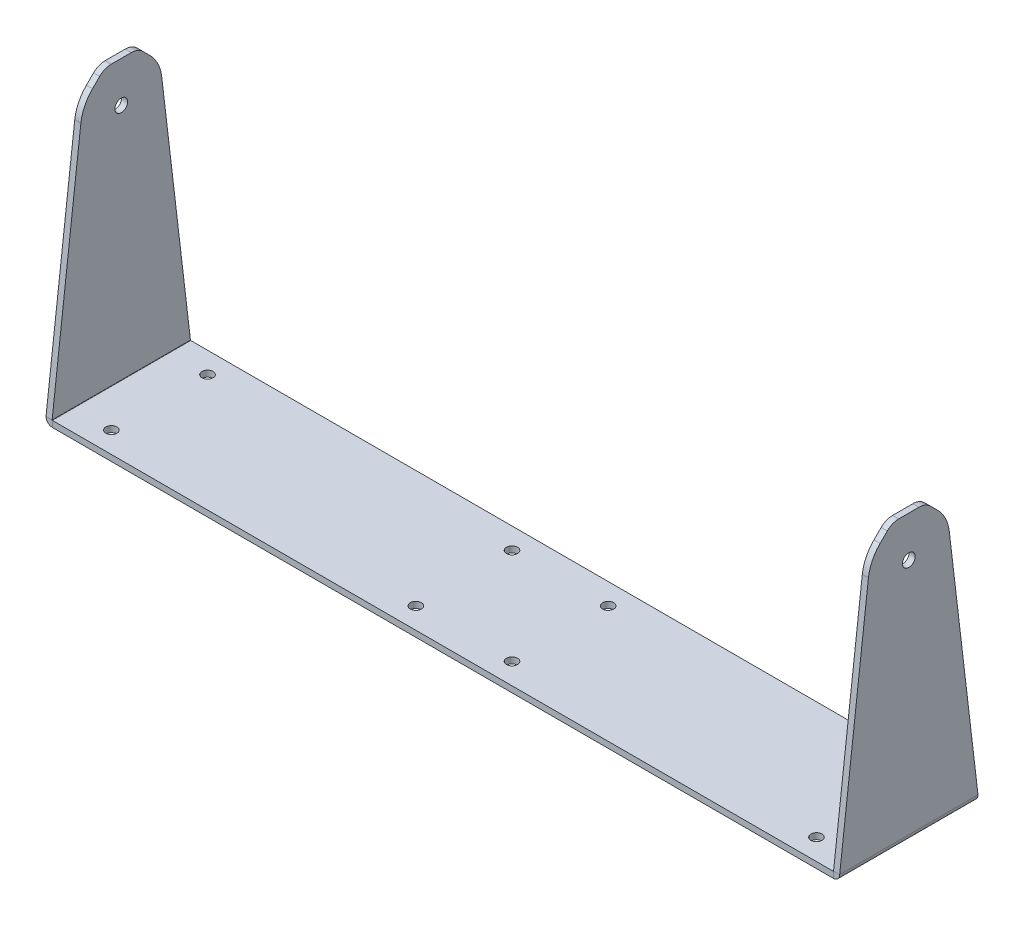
ISO-10303-21;
HEADER;
FILE_DESCRIPTION(('STEP AP214'),'2;1');
FILE_NAME('part.step','',(''),(''),'','','');
FILE_SCHEMA(('AUTOMOTIVE_DESIGN { 1 0 10303 214 1 1 1 1 }'));
ENDSEC;
DATA;
#1=APPLICATION_CONTEXT('core data for automotive mechanical design processes');
#2=APPLICATION_PROTOCOL_DEFINITION('international standard','automotive_design',2000,#1);
#3=PRODUCT_CONTEXT('',#1,'mechanical');
#4=PRODUCT('Part','Part','',(#3));
#5=PRODUCT_RELATED_PRODUCT_CATEGORY('part','',(#4));
#6=PRODUCT_DEFINITION_FORMATION('','',#4);
#7=PRODUCT_DEFINITION_CONTEXT('part definition',#1,'design');
#8=PRODUCT_DEFINITION('design','',#6,#7);
#9=PRODUCT_DEFINITION_SHAPE('','',#8);
#10=(LENGTH_UNIT() NAMED_UNIT(*) SI_UNIT(.MILLI.,.METRE.));
#11=(NAMED_UNIT(*) PLANE_ANGLE_UNIT() SI_UNIT($,.RADIAN.));
#12=(NAMED_UNIT(*) SI_UNIT($,.STERADIAN.) SOLID_ANGLE_UNIT());
#13=UNCERTAINTY_MEASURE_WITH_UNIT(LENGTH_MEASURE(1.E-05),#10,'distance_accuracy_value','');
#14=(GEOMETRIC_REPRESENTATION_CONTEXT(3) GLOBAL_UNCERTAINTY_ASSIGNED_CONTEXT((#13)) GLOBAL_UNIT_ASSIGNED_CONTEXT((#10,
#11,#12)) REPRESENTATION_CONTEXT('',''));
#15=CARTESIAN_POINT('',(0.,0.,0.));
#16=DIRECTION('',(0.,0.,1.));
#17=DIRECTION('',(1.,0.,0.));
#18=AXIS2_PLACEMENT_3D('',#15,#16,#17);
#19=CARTESIAN_POINT('',(0.,4.7752,0.));
#20=DIRECTION('',(0.,-1.,0.));
#21=DIRECTION('',(0.,0.,-1.));
#22=AXIS2_PLACEMENT_3D('',#19,#20,#21);
#23=PLANE('',#22);
#24=CARTESIAN_POINT('',(-37.5,4.7752,-37.5));
#25=DIRECTION('',(0.,1.,0.));
#26=DIRECTION('',(0.,0.,1.));
#27=AXIS2_PLACEMENT_3D('',#24,#25,#26);
#28=CIRCLE('',#27,4.31799999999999);
#29=CARTESIAN_POINT('',(-37.5,4.7752,-33.182));
#30=VERTEX_POINT('',#29);
#31=EDGE_CURVE('E293',#30,#30,#28,.T.);
#32=ORIENTED_EDGE('',*,*,#31,.F.);
#33=EDGE_LOOP('',(#32));
#34=FACE_BOUND('',#33,.T.);
#35=CARTESIAN_POINT('',(37.5,4.7752,-37.5));
#36=DIRECTION('',(0.,1.,0.));
#37=DIRECTION('',(0.,0.,1.));
#38=AXIS2_PLACEMENT_3D('',#35,#36,#37);
#39=CIRCLE('',#38,4.318);
#40=CARTESIAN_POINT('',(37.5,4.7752,-33.182));
#41=VERTEX_POINT('',#40);
#42=EDGE_CURVE('E287',#41,#41,#39,.T.);
#43=ORIENTED_EDGE('',*,*,#42,.F.);
#44=EDGE_LOOP('',(#43));
#45=FACE_BOUND('',#44,.T.);
#46=CARTESIAN_POINT('',(37.5,4.7752,37.5));
#47=DIRECTION('',(0.,1.,0.));
#48=DIRECTION('',(0.,0.,1.));
#49=AXIS2_PLACEMENT_3D('',#46,#47,#48);
#50=CIRCLE('',#49,4.318);
#51=CARTESIAN_POINT('',(37.5,4.7752,41.818));
#52=VERTEX_POINT('',#51);
#53=EDGE_CURVE('E281',#52,#52,#50,.T.);
#54=ORIENTED_EDGE('',*,*,#53,.F.);
#55=EDGE_LOOP('',(#54));
#56=FACE_BOUND('',#55,.T.);
#57=CARTESIAN_POINT('',(-37.5,4.7752,37.5));
#58=DIRECTION('',(0.,1.,0.));
#59=DIRECTION('',(0.,0.,1.));
#60=AXIS2_PLACEMENT_3D('',#57,#58,#59);
#61=CIRCLE('',#60,4.318);
#62=CARTESIAN_POINT('',(-37.5,4.7752,41.818));
#63=VERTEX_POINT('',#62);
#64=EDGE_CURVE('E275',#63,#63,#61,.T.);
#65=ORIENTED_EDGE('',*,*,#64,.F.);
#66=EDGE_LOOP('',(#65));
#67=FACE_BOUND('',#66,.T.);
#68=CARTESIAN_POINT('',(-275.000000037,4.7752,37.5));
#69=DIRECTION('',(0.,1.,0.));
#70=DIRECTION('',(0.,0.,1.));
#71=AXIS2_PLACEMENT_3D('',#68,#69,#70);
#72=CIRCLE('',#71,4.31799999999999);
#73=CARTESIAN_POINT('',(-275.000000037,4.7752,41.818));
#74=VERTEX_POINT('',#73);
#75=EDGE_CURVE('E269',#74,#74,#72,.T.);
#76=ORIENTED_EDGE('',*,*,#75,.F.);
#77=EDGE_LOOP('',(#76));
#78=FACE_BOUND('',#77,.T.);
#79=CARTESIAN_POINT('',(-275.000000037,4.7752,-37.5));
#80=DIRECTION('',(0.,1.,0.));
#81=DIRECTION('',(0.,0.,1.));
#82=AXIS2_PLACEMENT_3D('',#79,#80,#81);
#83=CIRCLE('',#82,4.31799999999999);
#84=CARTESIAN_POINT('',(-275.000000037,4.7752,-33.182));
#85=VERTEX_POINT('',#84);
#86=EDGE_CURVE('E263',#85,#85,#83,.T.);
#87=ORIENTED_EDGE('',*,*,#86,.F.);
#88=EDGE_LOOP('',(#87));
#89=FACE_BOUND('',#88,.T.);
#90=CARTESIAN_POINT('',(275.000000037,4.7752,-37.5));
#91=DIRECTION('',(0.,1.,0.));
#92=DIRECTION('',(0.,0.,1.));
#93=AXIS2_PLACEMENT_3D('',#90,#91,#92);
#94=CIRCLE('',#93,4.31800000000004);
#95=CARTESIAN_POINT('',(275.000000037,4.7752,-33.182));
#96=VERTEX_POINT('',#95);
#97=EDGE_CURVE('E257',#96,#96,#94,.T.);
#98=ORIENTED_EDGE('',*,*,#97,.F.);
#99=EDGE_LOOP('',(#98));
#100=FACE_BOUND('',#99,.T.);
#101=CARTESIAN_POINT('',(275.000000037,4.7752,37.5));
#102=DIRECTION('',(0.,1.,0.));
#103=DIRECTION('',(0.,0.,1.));
#104=AXIS2_PLACEMENT_3D('',#101,#102,#103);
#105=CIRCLE('',#104,4.31800000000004);
#106=CARTESIAN_POINT('',(275.000000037,4.7752,41.818));
#107=VERTEX_POINT('',#106);
#108=EDGE_CURVE('E251',#107,#107,#105,.T.);
#109=ORIENTED_EDGE('',*,*,#108,.F.);
#110=EDGE_LOOP('',(#109));
#111=FACE_BOUND('',#110,.T.);
#112=DIRECTION('',(0.,0.,1.));
#113=VECTOR('',#112,1.);
#114=CARTESIAN_POINT('',(-304.5841,4.7751999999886,53.975));
#115=LINE('',#114,#113);
#116=CARTESIAN_POINT('',(-304.5841,4.7751999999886,53.975));
#117=VERTEX_POINT('',#116);
#118=CARTESIAN_POINT('',(-304.5841,4.7751999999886,-53.975));
#119=VERTEX_POINT('',#118);
#120=EDGE_CURVE('E1033',#117,#119,#115,.F.);
#121=ORIENTED_EDGE('',*,*,#120,.F.);
#122=DIRECTION('',(1.,0.,0.));
#123=VECTOR('',#122,1.);
#124=CARTESIAN_POINT('',(-309.5625,4.7752,53.975));
#125=LINE('',#124,#123);
#126=CARTESIAN_POINT('',(304.5841,4.7751999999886,53.975));
#127=VERTEX_POINT('',#126);
#128=EDGE_CURVE('E136',#117,#127,#125,.T.);
#129=ORIENTED_EDGE('',*,*,#128,.T.);
#130=DIRECTION('',(0.,0.,-1.));
#131=VECTOR('',#130,1.);
#132=CARTESIAN_POINT('',(304.5841,4.7751999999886,-53.975));
#133=LINE('',#132,#131);
#134=CARTESIAN_POINT('',(304.5841,4.7751999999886,-53.975));
#135=VERTEX_POINT('',#134);
#136=EDGE_CURVE('E191',#135,#127,#133,.F.);
#137=ORIENTED_EDGE('',*,*,#136,.F.);
#138=DIRECTION('',(-1.,0.,0.));
#139=VECTOR('',#138,1.);
#140=CARTESIAN_POINT('',(-309.5625,4.7752,-53.975));
#141=LINE('',#140,#139);
#142=EDGE_CURVE('E13',#135,#119,#141,.T.);
#143=ORIENTED_EDGE('',*,*,#142,.T.);
#144=EDGE_LOOP('',(#121,#129,#137,#143));
#145=FACE_BOUND('',#144,.T.);
#146=ADVANCED_FACE('F127',(#34,#45,#56,#67,#78,#89,#100,#111,#145),#23,.F.);
#147=CARTESIAN_POINT('',(0.,0.,0.));
#148=DIRECTION('',(0.,-1.,0.));
#149=DIRECTION('',(0.,0.,-1.));
#150=AXIS2_PLACEMENT_3D('',#147,#148,#149);
#151=PLANE('',#150);
#152=CARTESIAN_POINT('',(275.000000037,0.,-37.5));
#153=DIRECTION('',(0.,1.,0.));
#154=DIRECTION('',(0.,0.,1.));
#155=AXIS2_PLACEMENT_3D('',#152,#153,#154);
#156=CIRCLE('',#155,4.31800000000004);
#157=CARTESIAN_POINT('',(275.000000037,0.,-33.182));
#158=VERTEX_POINT('',#157);
#159=EDGE_CURVE('E254',#158,#158,#156,.T.);
#160=ORIENTED_EDGE('',*,*,#159,.T.);
#161=EDGE_LOOP('',(#160));
#162=FACE_BOUND('',#161,.T.);
#163=CARTESIAN_POINT('',(-275.000000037,0.,37.5));
#164=DIRECTION('',(0.,1.,0.));
#165=DIRECTION('',(0.,0.,1.));
#166=AXIS2_PLACEMENT_3D('',#163,#164,#165);
#167=CIRCLE('',#166,4.31799999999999);
#168=CARTESIAN_POINT('',(-275.000000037,0.,41.818));
#169=VERTEX_POINT('',#168);
#170=EDGE_CURVE('E266',#169,#169,#167,.T.);
#171=ORIENTED_EDGE('',*,*,#170,.T.);
#172=EDGE_LOOP('',(#171));
#173=FACE_BOUND('',#172,.T.);
#174=CARTESIAN_POINT('',(37.5,0.,37.5));
#175=DIRECTION('',(0.,1.,0.));
#176=DIRECTION('',(0.,0.,1.));
#177=AXIS2_PLACEMENT_3D('',#174,#175,#176);
#178=CIRCLE('',#177,4.318);
#179=CARTESIAN_POINT('',(37.5,0.,41.818));
#180=VERTEX_POINT('',#179);
#181=EDGE_CURVE('E278',#180,#180,#178,.T.);
#182=ORIENTED_EDGE('',*,*,#181,.T.);
#183=EDGE_LOOP('',(#182));
#184=FACE_BOUND('',#183,.T.);
#185=CARTESIAN_POINT('',(-37.5,0.,-37.5));
#186=DIRECTION('',(0.,1.,0.));
#187=DIRECTION('',(0.,0.,1.));
#188=AXIS2_PLACEMENT_3D('',#185,#186,#187);
#189=CIRCLE('',#188,4.31799999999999);
#190=CARTESIAN_POINT('',(-37.5,0.,-33.182));
#191=VERTEX_POINT('',#190);
#192=EDGE_CURVE('E290',#191,#191,#189,.T.);
#193=ORIENTED_EDGE('',*,*,#192,.T.);
#194=EDGE_LOOP('',(#193));
#195=FACE_BOUND('',#194,.T.);
#196=CARTESIAN_POINT('',(37.5,0.,-37.5));
#197=DIRECTION('',(0.,1.,0.));
#198=DIRECTION('',(0.,0.,1.));
#199=AXIS2_PLACEMENT_3D('',#196,#197,#198);
#200=CIRCLE('',#199,4.318);
#201=CARTESIAN_POINT('',(37.5,0.,-33.182));
#202=VERTEX_POINT('',#201);
#203=EDGE_CURVE('E284',#202,#202,#200,.T.);
#204=ORIENTED_EDGE('',*,*,#203,.T.);
#205=EDGE_LOOP('',(#204));
#206=FACE_BOUND('',#205,.T.);
#207=CARTESIAN_POINT('',(-37.5,0.,37.5));
#208=DIRECTION('',(0.,1.,0.));
#209=DIRECTION('',(0.,0.,1.));
#210=AXIS2_PLACEMENT_3D('',#207,#208,#209);
#211=CIRCLE('',#210,4.318);
#212=CARTESIAN_POINT('',(-37.5,0.,41.818));
#213=VERTEX_POINT('',#212);
#214=EDGE_CURVE('E272',#213,#213,#211,.T.);
#215=ORIENTED_EDGE('',*,*,#214,.T.);
#216=EDGE_LOOP('',(#215));
#217=FACE_BOUND('',#216,.T.);
#218=CARTESIAN_POINT('',(-275.000000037,0.,-37.5));
#219=DIRECTION('',(0.,1.,0.));
#220=DIRECTION('',(0.,0.,1.));
#221=AXIS2_PLACEMENT_3D('',#218,#219,#220);
#222=CIRCLE('',#221,4.31799999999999);
#223=CARTESIAN_POINT('',(-275.000000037,0.,-33.182));
#224=VERTEX_POINT('',#223);
#225=EDGE_CURVE('E260',#224,#224,#222,.T.);
#226=ORIENTED_EDGE('',*,*,#225,.T.);
#227=EDGE_LOOP('',(#226));
#228=FACE_BOUND('',#227,.T.);
#229=CARTESIAN_POINT('',(275.000000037,0.,37.5));
#230=DIRECTION('',(0.,1.,0.));
#231=DIRECTION('',(0.,0.,1.));
#232=AXIS2_PLACEMENT_3D('',#229,#230,#231);
#233=CIRCLE('',#232,4.31800000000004);
#234=CARTESIAN_POINT('',(275.000000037,0.,41.818));
#235=VERTEX_POINT('',#234);
#236=EDGE_CURVE('E249',#235,#235,#233,.T.);
#237=ORIENTED_EDGE('',*,*,#236,.T.);
#238=EDGE_LOOP('',(#237));
#239=FACE_BOUND('',#238,.T.);
#240=DIRECTION('',(1.,0.,0.));
#241=VECTOR('',#240,1.);
#242=CARTESIAN_POINT('',(-309.5625,0.,53.975));
#243=LINE('',#242,#241);
#244=CARTESIAN_POINT('',(-304.5841,-1.13988679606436E-11,53.975));
#245=VERTEX_POINT('',#244);
#246=CARTESIAN_POINT('',(304.5841,0.,53.975));
#247=VERTEX_POINT('',#246);
#248=EDGE_CURVE('E144',#245,#247,#243,.T.);
#249=ORIENTED_EDGE('',*,*,#248,.F.);
#250=DIRECTION('',(0.,0.,1.));
#251=VECTOR('',#250,1.);
#252=CARTESIAN_POINT('',(-304.5841,-1.13988679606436E-11,53.975));
#253=LINE('',#252,#251);
#254=CARTESIAN_POINT('',(-304.5841,0.,-53.975));
#255=VERTEX_POINT('',#254);
#256=EDGE_CURVE('E306',#245,#255,#253,.F.);
#257=ORIENTED_EDGE('',*,*,#256,.T.);
#258=DIRECTION('',(-1.,0.,0.));
#259=VECTOR('',#258,1.);
#260=CARTESIAN_POINT('',(-309.5625,0.,-53.975));
#261=LINE('',#260,#259);
#262=CARTESIAN_POINT('',(304.5841,-1.13988679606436E-11,-53.975));
#263=VERTEX_POINT('',#262);
#264=EDGE_CURVE('E131',#263,#255,#261,.T.);
#265=ORIENTED_EDGE('',*,*,#264,.F.);
#266=DIRECTION('',(0.,0.,-1.));
#267=VECTOR('',#266,1.);
#268=CARTESIAN_POINT('',(304.5841,-1.13988679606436E-11,-53.975));
#269=LINE('',#268,#267);
#270=EDGE_CURVE('E152',#263,#247,#269,.F.);
#271=ORIENTED_EDGE('',*,*,#270,.T.);
#272=EDGE_LOOP('',(#249,#257,#265,#271));
#273=FACE_BOUND('',#272,.T.);
#274=ADVANCED_FACE('F307',(#162,#173,#184,#195,#206,#217,#228,#239,#273),#151,.T.);
#275=CARTESIAN_POINT('',(-309.5625,4.7752,53.975));
#276=DIRECTION('',(0.,0.,-1.));
#277=DIRECTION('',(-1.,0.,0.));
#278=AXIS2_PLACEMENT_3D('',#275,#276,#277);
#279=PLANE('',#278);
#280=DIRECTION('',(0.,-1.,0.));
#281=VECTOR('',#280,1.);
#282=CARTESIAN_POINT('',(-304.5841,4.7751999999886,53.975));
#283=LINE('',#282,#281);
#284=EDGE_CURVE('E315',#117,#245,#283,.T.);
#285=ORIENTED_EDGE('',*,*,#284,.T.);
#286=ORIENTED_EDGE('',*,*,#248,.T.);
#287=DIRECTION('',(0.,-1.,0.));
#288=VECTOR('',#287,1.);
#289=CARTESIAN_POINT('',(304.5841,4.7751999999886,53.975));
#290=LINE('',#289,#288);
#291=EDGE_CURVE('E183',#127,#247,#290,.T.);
#292=ORIENTED_EDGE('',*,*,#291,.F.);
#293=ORIENTED_EDGE('',*,*,#128,.F.);
#294=EDGE_LOOP('',(#285,#286,#292,#293));
#295=FACE_BOUND('',#294,.T.);
#296=ADVANCED_FACE('F129',(#295),#279,.F.);
#297=CARTESIAN_POINT('',(-309.5625,4.7752,-53.975));
#298=DIRECTION('',(0.,0.,1.));
#299=DIRECTION('',(1.,0.,0.));
#300=AXIS2_PLACEMENT_3D('',#297,#298,#299);
#301=PLANE('',#300);
#302=DIRECTION('',(0.,-1.,0.));
#303=VECTOR('',#302,1.);
#304=CARTESIAN_POINT('',(-304.5841,4.7751999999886,-53.975));
#305=LINE('',#304,#303);
#306=EDGE_CURVE('E201',#119,#255,#305,.T.);
#307=ORIENTED_EDGE('',*,*,#306,.F.);
#308=ORIENTED_EDGE('',*,*,#142,.F.);
#309=DIRECTION('',(0.,-1.,0.));
#310=VECTOR('',#309,1.);
#311=CARTESIAN_POINT('',(304.5841,4.7751999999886,-53.975));
#312=LINE('',#311,#310);
#313=EDGE_CURVE('E172',#135,#263,#312,.T.);
#314=ORIENTED_EDGE('',*,*,#313,.T.);
#315=ORIENTED_EDGE('',*,*,#264,.T.);
#316=EDGE_LOOP('',(#307,#308,#314,#315));
#317=FACE_BOUND('',#316,.T.);
#318=ADVANCED_FACE('F198',(#317),#301,.F.);
#319=CARTESIAN_POINT('',(-37.5,4.7752,-37.5));
#320=DIRECTION('',(0.,-1.,0.));
#321=DIRECTION('',(0.,0.,-1.));
#322=AXIS2_PLACEMENT_3D('',#319,#320,#321);
#323=CYLINDRICAL_SURFACE('',#322,4.31799999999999);
#324=ORIENTED_EDGE('',*,*,#31,.T.);
#325=EDGE_LOOP('',(#324));
#326=FACE_BOUND('',#325,.T.);
#327=ORIENTED_EDGE('',*,*,#192,.F.);
#328=EDGE_LOOP('',(#327));
#329=FACE_BOUND('',#328,.T.);
#330=ADVANCED_FACE('F554',(#326,#329),#323,.F.);
#331=CARTESIAN_POINT('',(37.5,4.7752,-37.5));
#332=DIRECTION('',(0.,-1.,0.));
#333=DIRECTION('',(0.,0.,-1.));
#334=AXIS2_PLACEMENT_3D('',#331,#332,#333);
#335=CYLINDRICAL_SURFACE('',#334,4.318);
#336=ORIENTED_EDGE('',*,*,#42,.T.);
#337=EDGE_LOOP('',(#336));
#338=FACE_BOUND('',#337,.T.);
#339=ORIENTED_EDGE('',*,*,#203,.F.);
#340=EDGE_LOOP('',(#339));
#341=FACE_BOUND('',#340,.T.);
#342=ADVANCED_FACE('F561',(#338,#341),#335,.F.);
#343=CARTESIAN_POINT('',(37.5,4.7752,37.5));
#344=DIRECTION('',(0.,-1.,0.));
#345=DIRECTION('',(0.,0.,-1.));
#346=AXIS2_PLACEMENT_3D('',#343,#344,#345);
#347=CYLINDRICAL_SURFACE('',#346,4.318);
#348=ORIENTED_EDGE('',*,*,#53,.T.);
#349=EDGE_LOOP('',(#348));
#350=FACE_BOUND('',#349,.T.);
#351=ORIENTED_EDGE('',*,*,#181,.F.);
#352=EDGE_LOOP('',(#351));
#353=FACE_BOUND('',#352,.T.);
#354=ADVANCED_FACE('F767',(#350,#353),#347,.F.);
#355=CARTESIAN_POINT('',(-37.5,4.7752,37.5));
#356=DIRECTION('',(0.,-1.,0.));
#357=DIRECTION('',(0.,0.,-1.));
#358=AXIS2_PLACEMENT_3D('',#355,#356,#357);
#359=CYLINDRICAL_SURFACE('',#358,4.318);
#360=ORIENTED_EDGE('',*,*,#64,.T.);
#361=EDGE_LOOP('',(#360));
#362=FACE_BOUND('',#361,.T.);
#363=ORIENTED_EDGE('',*,*,#214,.F.);
#364=EDGE_LOOP('',(#363));
#365=FACE_BOUND('',#364,.T.);
#366=ADVANCED_FACE('F756',(#362,#365),#359,.F.);
#367=CARTESIAN_POINT('',(-275.000000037,4.7752,37.5));
#368=DIRECTION('',(0.,-1.,0.));
#369=DIRECTION('',(0.,0.,-1.));
#370=AXIS2_PLACEMENT_3D('',#367,#368,#369);
#371=CYLINDRICAL_SURFACE('',#370,4.31799999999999);
#372=ORIENTED_EDGE('',*,*,#75,.T.);
#373=EDGE_LOOP('',(#372));
#374=FACE_BOUND('',#373,.T.);
#375=ORIENTED_EDGE('',*,*,#170,.F.);
#376=EDGE_LOOP('',(#375));
#377=FACE_BOUND('',#376,.T.);
#378=ADVANCED_FACE('F745',(#374,#377),#371,.F.);
#379=CARTESIAN_POINT('',(-275.000000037,4.7752,-37.5));
#380=DIRECTION('',(0.,-1.,0.));
#381=DIRECTION('',(0.,0.,-1.));
#382=AXIS2_PLACEMENT_3D('',#379,#380,#381);
#383=CYLINDRICAL_SURFACE('',#382,4.31799999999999);
#384=ORIENTED_EDGE('',*,*,#86,.T.);
#385=EDGE_LOOP('',(#384));
#386=FACE_BOUND('',#385,.T.);
#387=ORIENTED_EDGE('',*,*,#225,.F.);
#388=EDGE_LOOP('',(#387));
#389=FACE_BOUND('',#388,.T.);
#390=ADVANCED_FACE('F734',(#386,#389),#383,.F.);
#391=CARTESIAN_POINT('',(275.000000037,4.7752,-37.5));
#392=DIRECTION('',(0.,-1.,0.));
#393=DIRECTION('',(0.,0.,-1.));
#394=AXIS2_PLACEMENT_3D('',#391,#392,#393);
#395=CYLINDRICAL_SURFACE('',#394,4.31800000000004);
#396=ORIENTED_EDGE('',*,*,#97,.T.);
#397=EDGE_LOOP('',(#396));
#398=FACE_BOUND('',#397,.T.);
#399=ORIENTED_EDGE('',*,*,#159,.F.);
#400=EDGE_LOOP('',(#399));
#401=FACE_BOUND('',#400,.T.);
#402=ADVANCED_FACE('F723',(#398,#401),#395,.F.);
#403=CARTESIAN_POINT('',(275.000000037,4.7752,37.5));
#404=DIRECTION('',(0.,-1.,0.));
#405=DIRECTION('',(0.,0.,-1.));
#406=AXIS2_PLACEMENT_3D('',#403,#404,#405);
#407=CYLINDRICAL_SURFACE('',#406,4.31800000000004);
#408=ORIENTED_EDGE('',*,*,#108,.T.);
#409=EDGE_LOOP('',(#408));
#410=FACE_BOUND('',#409,.T.);
#411=ORIENTED_EDGE('',*,*,#236,.F.);
#412=EDGE_LOOP('',(#411));
#413=FACE_BOUND('',#412,.T.);
#414=ADVANCED_FACE('F714',(#410,#413),#407,.F.);
#415=CARTESIAN_POINT('',(304.5841,-0.0477520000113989,53.975));
#416=CARTESIAN_POINT('',(305.242140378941,-0.0477520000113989,53.9729935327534));
#417=CARTESIAN_POINT('',(305.899684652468,0.083065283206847,53.9709877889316));
#418=CARTESIAN_POINT('',(307.115365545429,0.58661679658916,53.9669755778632));
#419=CARTESIAN_POINT('',(307.672905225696,0.959152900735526,53.964969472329));
#420=CARTESIAN_POINT('',(308.603347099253,1.88959477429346,53.9609572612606));
#421=CARTESIAN_POINT('',(308.9758832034,2.44713445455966,53.9589511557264));
#422=CARTESIAN_POINT('',(309.479434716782,3.66281534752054,53.954938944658));
#423=CARTESIAN_POINT('',(309.610252,4.3203596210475,53.9529332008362));
#424=CARTESIAN_POINT('',(309.610252,4.97839999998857,53.9509267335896));
#425=CARTESIAN_POINT('',(304.5841,-1.13988679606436E-11,53.975));
#426=CARTESIAN_POINT('',(305.23588852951,-1.13988706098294E-11,53.9729935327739));
#427=CARTESIAN_POINT('',(305.887185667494,0.129574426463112,53.9709877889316));
#428=CARTESIAN_POINT('',(307.091316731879,0.628341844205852,53.9669755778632));
#429=CARTESIAN_POINT('',(307.643559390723,0.997338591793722,53.964969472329));
#430=CARTESIAN_POINT('',(308.565161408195,1.9189406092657,53.9609572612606));
#431=CARTESIAN_POINT('',(308.934158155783,2.47118326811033,53.9589511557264));
#432=CARTESIAN_POINT('',(309.432925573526,3.67531433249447,53.954938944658));
#433=CARTESIAN_POINT('',(309.5625,4.3266114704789,53.9529332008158));
#434=CARTESIAN_POINT('',(309.5625,4.97839999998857,53.9509267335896));
#435=CARTESIAN_POINT('',(304.5841,4.7751999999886,53.975));
#436=CARTESIAN_POINT('',(304.61070358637,4.7751999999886,53.9729935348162));
#437=CARTESIAN_POINT('',(304.637287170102,4.7804887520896,53.9709877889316));
#438=CARTESIAN_POINT('',(304.686435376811,4.80084660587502,53.9669755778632));
#439=CARTESIAN_POINT('',(304.708975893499,4.81590769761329,53.964969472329));
#440=CARTESIAN_POINT('',(304.746592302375,4.8535241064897,53.9609572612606));
#441=CARTESIAN_POINT('',(304.761653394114,4.87606462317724,53.9589511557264));
#442=CARTESIAN_POINT('',(304.782011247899,4.9252128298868,53.954938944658));
#443=CARTESIAN_POINT('',(304.7873,4.95179641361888,53.9529331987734));
#444=CARTESIAN_POINT('',(304.7873,4.97839999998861,53.9509267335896));
#445=CARTESIAN_POINT('',(304.5841,4.8234295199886,53.975));
#446=CARTESIAN_POINT('',(304.604389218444,4.8234295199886,53.9729935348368));
#447=CARTESIAN_POINT('',(304.624663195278,4.82746298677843,53.9709877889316));
#448=CARTESIAN_POINT('',(304.662146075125,4.84298890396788,53.9669755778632));
#449=CARTESIAN_POINT('',(304.679336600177,4.85447524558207,53.964969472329));
#450=CARTESIAN_POINT('',(304.708024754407,4.88316339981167,53.9609572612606));
#451=CARTESIAN_POINT('',(304.719511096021,4.90035392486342,53.9589511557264));
#452=CARTESIAN_POINT('',(304.73503701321,4.93783680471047,53.954938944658));
#453=CARTESIAN_POINT('',(304.73907048,4.95811078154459,53.9529331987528));
#454=CARTESIAN_POINT('',(304.73907048,4.97839999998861,53.9509267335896));
#455=B_SPLINE_SURFACE_WITH_KNOTS('',1,3,((#415,#416,#417,#418,#419,#420,#421,#422,#423,#424),
(#425,#426,#427,#428,#429,#430,#431,#432,#433,#434),(#435,#436,#437,#438,#439,#440,#441,#442,
#443,#444),(#445,#446,#447,#448,#449,#450,#451,#452,#453,#454)),.UNSPECIFIED.,.F.,.F.,.F.,(2,1,
1,2),(4,2,2,2,4),(-0.01,0.,1.,1.0101),(0.,0.25,0.5,0.75,1.),.UNSPECIFIED.);
#456=DIRECTION('',(-1.,0.,0.));
#457=VECTOR('',#456,1.);
#458=CARTESIAN_POINT('',(309.5625,4.9783999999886,53.9509267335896));
#459=LINE('',#458,#457);
#460=CARTESIAN_POINT('',(304.7873,4.97839999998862,53.9509267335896));
#461=VERTEX_POINT('',#460);
#462=CARTESIAN_POINT('',(309.5625,4.9783999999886,53.9509267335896));
#463=VERTEX_POINT('',#462);
#464=EDGE_CURVE('E209',#461,#463,#459,.F.);
#465=CARTESIAN_POINT('',(304.5841,4.7751999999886,53.975));
#466=CARTESIAN_POINT('',(304.587424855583,4.77519992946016,53.9747492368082));
#467=CARTESIAN_POINT('',(304.590749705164,4.77528160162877,53.9744984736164));
#468=CARTESIAN_POINT('',(304.597391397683,4.77560792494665,53.9739969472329));
#469=CARTESIAN_POINT('',(304.60070824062,4.77585257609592,53.9737461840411));
#470=CARTESIAN_POINT('',(304.60732592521,4.7765043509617,53.9732446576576));
#471=CARTESIAN_POINT('',(304.610626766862,4.7769114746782,53.9729938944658));
#472=CARTESIAN_POINT('',(304.617204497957,4.77788719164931,53.9724923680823));
#473=CARTESIAN_POINT('',(304.620481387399,4.77845578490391,53.9722416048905));
#474=CARTESIAN_POINT('',(304.627003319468,4.77975307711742,53.9717400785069));
#475=CARTESIAN_POINT('',(304.630248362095,4.78048177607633,53.9714893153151));
#476=CARTESIAN_POINT('',(304.636698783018,4.78209752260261,53.9709877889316));
#477=CARTESIAN_POINT('',(304.639904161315,4.78298457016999,53.9707370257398));
#478=CARTESIAN_POINT('',(304.646267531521,4.78491487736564,53.9702354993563));
#479=CARTESIAN_POINT('',(304.649425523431,4.78595813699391,53.9699847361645));
#480=CARTESIAN_POINT('',(304.655686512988,4.78819835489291,53.969483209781));
#481=CARTESIAN_POINT('',(304.658789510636,4.78939531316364,53.9692324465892));
#482=CARTESIAN_POINT('',(304.664933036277,4.79194004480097,53.9687309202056));
#483=CARTESIAN_POINT('',(304.667973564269,4.79328781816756,53.9684801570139));
#484=CARTESIAN_POINT('',(304.673984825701,4.79613093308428,53.9679786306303));
#485=CARTESIAN_POINT('',(304.67695555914,4.7976262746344,53.9677278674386));
#486=CARTESIAN_POINT('',(304.682820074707,4.80076092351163,53.967226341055));
#487=CARTESIAN_POINT('',(304.685713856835,4.80240023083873,53.9669755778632));
#488=CARTESIAN_POINT('',(304.691417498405,4.80581886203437,53.9664740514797));
#489=CARTESIAN_POINT('',(304.694227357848,4.80759818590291,53.9662232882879));
#490=CARTESIAN_POINT('',(304.699756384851,4.81129256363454,53.9657217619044));
#491=CARTESIAN_POINT('',(304.702475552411,4.81320761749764,53.9654709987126));
#492=CARTESIAN_POINT('',(304.707816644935,4.81716884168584,53.964969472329));
#493=CARTESIAN_POINT('',(304.710438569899,4.81921501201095,53.9647187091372));
#494=CARTESIAN_POINT('',(304.715578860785,4.82343353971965,53.9642171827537));
#495=CARTESIAN_POINT('',(304.718097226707,4.82560589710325,53.9639664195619));
#496=CARTESIAN_POINT('',(304.723024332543,4.83007156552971,53.9634648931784));
#497=CARTESIAN_POINT('',(304.725433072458,4.83236487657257,53.9632141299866));
#498=CARTESIAN_POINT('',(304.730135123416,4.83706692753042,53.962712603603));
#499=CARTESIAN_POINT('',(304.732428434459,4.83947566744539,53.9624618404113));
#500=CARTESIAN_POINT('',(304.736894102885,4.844402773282,53.9619603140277));
#501=CARTESIAN_POINT('',(304.739066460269,4.84692113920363,53.961709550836));
#502=CARTESIAN_POINT('',(304.743284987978,4.85206143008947,53.9612080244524));
#503=CARTESIAN_POINT('',(304.745331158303,4.85468335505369,53.9609572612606));
#504=CARTESIAN_POINT('',(304.749292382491,4.8600244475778,53.9604557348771));
#505=CARTESIAN_POINT('',(304.751207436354,4.86274361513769,53.9602049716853));
#506=CARTESIAN_POINT('',(304.754901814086,4.86827264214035,53.9597034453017));
#507=CARTESIAN_POINT('',(304.756681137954,4.87108250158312,53.95945268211));
#508=CARTESIAN_POINT('',(304.76009976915,4.87678614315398,53.9589511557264));
#509=CARTESIAN_POINT('',(304.761739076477,4.87967992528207,53.9587003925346));
#510=CARTESIAN_POINT('',(304.764873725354,4.88554444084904,53.9581988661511));
#511=CARTESIAN_POINT('',(304.766369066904,4.88851517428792,53.9579481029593));
#512=CARTESIAN_POINT('',(304.769212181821,4.89452643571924,53.9574465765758));
#513=CARTESIAN_POINT('',(304.770559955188,4.89756696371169,53.957195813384));
#514=CARTESIAN_POINT('',(304.773104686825,4.90371048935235,53.9566942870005));
#515=CARTESIAN_POINT('',(304.774301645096,4.90681348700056,53.9564435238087));
#516=CARTESIAN_POINT('',(304.776541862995,4.91307447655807,53.9559419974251));
#517=CARTESIAN_POINT('',(304.777585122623,4.91623246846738,53.9556912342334));
#518=CARTESIAN_POINT('',(304.779515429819,4.92259583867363,53.9551897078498));
#519=CARTESIAN_POINT('',(304.780402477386,4.92580121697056,53.954938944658));
#520=CARTESIAN_POINT('',(304.782018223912,4.93225163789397,53.9544374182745));
#521=CARTESIAN_POINT('',(304.782746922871,4.93549668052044,53.9541866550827));
#522=CARTESIAN_POINT('',(304.784044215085,4.94201861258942,53.9536851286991));
#523=CARTESIAN_POINT('',(304.784612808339,4.94529550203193,53.9534343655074));
#524=CARTESIAN_POINT('',(304.78558852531,4.95187323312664,53.9529328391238));
#525=CARTESIAN_POINT('',(304.785995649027,4.95517407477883,53.9526820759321));
#526=CARTESIAN_POINT('',(304.786647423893,4.96179175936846,53.9521805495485));
#527=CARTESIAN_POINT('',(304.786892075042,4.9651086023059,53.9519297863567));
#528=CARTESIAN_POINT('',(304.78721839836,4.97175029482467,53.9514282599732));
#529=CARTESIAN_POINT('',(304.787300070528,4.975075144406,53.9511774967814));
#530=CARTESIAN_POINT('',(304.7873,4.97839999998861,53.9509267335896));
#531=B_SPLINE_CURVE_WITH_KNOTS('',3,(#465,#466,#467,#468,#469,#470,#471,#472,#473,#474,#475,
#476,#477,#478,#479,#480,#481,#482,#483,#484,#485,#486,#487,#488,#489,#490,#491,#492,#493,#494,
#495,#496,#497,#498,#499,#500,#501,#502,#503,#504,#505,#506,#507,#508,#509,#510,#511,#512,#513,
#514,#515,#516,#517,#518,#519,#520,#521,#522,#523,#524,#525,#526,#527,#528,#529,#530),
.UNSPECIFIED.,.F.,.F.,(4,2,2,2,2,2,2,2,2,2,2,2,2,2,2,2,2,2,2,2,2,2,2,2,2,2,2,2,2,2,2,2,4),(0.,
0.010001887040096,0.020003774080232,0.0300056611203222,0.0400075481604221,0.0500094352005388,
0.060011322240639,0.0700132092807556,0.0800150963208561,0.0900169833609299,0.100018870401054,
0.110020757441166,0.120022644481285,0.13002453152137,0.140026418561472,0.150028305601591,
0.16003019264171,0.170032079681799,0.180033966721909,0.190035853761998,0.200037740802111,
0.210039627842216,0.220041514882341,0.230043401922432,0.240045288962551,0.250047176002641,
0.260049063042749,0.270050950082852,0.280052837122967,0.290054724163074,0.30005661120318,
0.310058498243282,0.320060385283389),.UNSPECIFIED.);
#532=EDGE_CURVE('E205',#127,#461,#531,.T.);
#533=CARTESIAN_POINT('',(304.5841,-1.13988679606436E-11,53.975));
#534=CARTESIAN_POINT('',(304.665558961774,-1.72795815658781E-06,53.9747492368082));
#535=CARTESIAN_POINT('',(304.747017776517,0.00199924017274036,53.9744984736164));
#536=CARTESIAN_POINT('',(304.909739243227,0.00999416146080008,53.9739969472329));
#537=CARTESIAN_POINT('',(304.991001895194,0.0159881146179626,53.9737461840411));
#538=CARTESIAN_POINT('',(305.15313516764,0.0319565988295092,53.9732446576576));
#539=CARTESIAN_POINT('',(305.234005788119,0.0419311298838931,53.9729938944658));
#540=CARTESIAN_POINT('',(305.395160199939,0.0658361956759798,53.9724923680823));
#541=CARTESIAN_POINT('',(305.47544399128,0.0797667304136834,53.9722416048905));
#542=CARTESIAN_POINT('',(305.63523132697,0.111550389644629,53.9717400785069));
#543=CARTESIAN_POINT('',(305.714734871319,0.12940351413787,53.9714893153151));
#544=CARTESIAN_POINT('',(305.872770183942,0.168989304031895,53.9709877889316));
#545=CARTESIAN_POINT('',(305.951301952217,0.190721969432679,53.9707370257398));
#546=CARTESIAN_POINT('',(306.10720452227,0.238014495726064,53.9702354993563));
#547=CARTESIAN_POINT('',(306.184575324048,0.263574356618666,53.9699847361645));
#548=CARTESIAN_POINT('',(306.337969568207,0.318459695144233,53.969483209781));
#549=CARTESIAN_POINT('',(306.413993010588,0.347785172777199,53.9692324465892));
#550=CARTESIAN_POINT('',(306.564509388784,0.410131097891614,53.9687309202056));
#551=CARTESIAN_POINT('',(306.6390023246,0.443151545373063,53.9684801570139));
#552=CARTESIAN_POINT('',(306.786278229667,0.512807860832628,53.9679786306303));
#553=CARTESIAN_POINT('',(306.859061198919,0.549443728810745,53.9677278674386));
#554=CARTESIAN_POINT('',(307.00274183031,0.626242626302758,53.967226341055));
#555=CARTESIAN_POINT('',(307.073639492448,0.666405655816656,53.9669755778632));
#556=CARTESIAN_POINT('',(307.213378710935,0.750162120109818,53.9664740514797));
#557=CARTESIAN_POINT('',(307.282220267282,0.793755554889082,53.9662232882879));
#558=CARTESIAN_POINT('',(307.417681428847,0.884267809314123,53.9657217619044));
#559=CARTESIAN_POINT('',(307.484301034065,0.9311866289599,53.9654709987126));
#560=CARTESIAN_POINT('',(307.615157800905,1.0282366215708,53.964969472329));
#561=CARTESIAN_POINT('',(307.679394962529,1.07836779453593,53.9647187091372));
#562=CARTESIAN_POINT('',(307.805332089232,1.18172172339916,53.9642171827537));
#563=CARTESIAN_POINT('',(307.867032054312,1.23494447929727,53.9639664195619));
#564=CARTESIAN_POINT('',(307.987746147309,1.34435335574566,53.9634648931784));
#565=CARTESIAN_POINT('',(308.046760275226,1.40053947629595,53.9632141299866));
#566=CARTESIAN_POINT('',(308.161960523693,1.51573972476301,53.962712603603));
#567=CARTESIAN_POINT('',(308.218146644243,1.57475385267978,53.9624618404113));
#568=CARTESIAN_POINT('',(308.327555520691,1.69546794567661,53.9619603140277));
#569=CARTESIAN_POINT('',(308.380778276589,1.75716791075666,53.961709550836));
#570=CARTESIAN_POINT('',(308.484132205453,1.88310503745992,53.9612080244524));
#571=CARTESIAN_POINT('',(308.534263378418,1.94734219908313,53.9609572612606));
#572=CARTESIAN_POINT('',(308.631313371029,2.0781989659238,53.9604557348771));
#573=CARTESIAN_POINT('',(308.678232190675,2.14481857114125,53.9602049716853));
#574=CARTESIAN_POINT('',(308.7687444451,2.28027973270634,53.9597034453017));
#575=CARTESIAN_POINT('',(308.812337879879,2.34912128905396,53.95945268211));
#576=CARTESIAN_POINT('',(308.896094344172,2.48886050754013,53.9589511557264));
#577=CARTESIAN_POINT('',(308.936257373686,2.55975816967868,53.9587003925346));
#578=CARTESIAN_POINT('',(309.013056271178,2.7034388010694,53.9581988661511));
#579=CARTESIAN_POINT('',(309.049692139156,2.77622177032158,53.9579481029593));
#580=CARTESIAN_POINT('',(309.119348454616,2.92349767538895,53.9574465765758));
#581=CARTESIAN_POINT('',(309.152368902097,2.99799061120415,53.957195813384));
#582=CARTESIAN_POINT('',(309.214714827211,3.14850698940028,53.9566942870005));
#583=CARTESIAN_POINT('',(309.244040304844,3.22453043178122,53.9564435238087));
#584=CARTESIAN_POINT('',(309.29892564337,3.37792467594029,53.9559419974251));
#585=CARTESIAN_POINT('',(309.324485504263,3.45529547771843,53.9556912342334));
#586=CARTESIAN_POINT('',(309.371778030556,3.61119804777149,53.9551897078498));
#587=CARTESIAN_POINT('',(309.393510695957,3.68972981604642,53.954938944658));
#588=CARTESIAN_POINT('',(309.433096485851,3.84776512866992,53.9544374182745));
#589=CARTESIAN_POINT('',(309.450949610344,3.92726867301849,53.9541866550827));
#590=CARTESIAN_POINT('',(309.482733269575,4.08705600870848,53.9536851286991));
#591=CARTESIAN_POINT('',(309.496663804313,4.16733980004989,53.9534343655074));
#592=CARTESIAN_POINT('',(309.520568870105,4.32849421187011,53.9529328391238));
#593=CARTESIAN_POINT('',(309.530543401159,4.40936483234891,53.9526820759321));
#594=CARTESIAN_POINT('',(309.546511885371,4.57149810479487,53.9521805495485));
#595=CARTESIAN_POINT('',(309.552505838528,4.65276075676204,53.9519297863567));
#596=CARTESIAN_POINT('',(309.560500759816,4.81548222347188,53.9514282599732));
#597=CARTESIAN_POINT('',(309.562501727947,4.89694103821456,53.9511774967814));
#598=CARTESIAN_POINT('',(309.5625,4.97839999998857,53.9509267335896));
#599=B_SPLINE_CURVE_WITH_KNOTS('',3,(#533,#534,#535,#536,#537,#538,#539,#540,#541,#542,#543,
#544,#545,#546,#547,#548,#549,#550,#551,#552,#553,#554,#555,#556,#557,#558,#559,#560,#561,#562,
#563,#564,#565,#566,#567,#568,#569,#570,#571,#572,#573,#574,#575,#576,#577,#578,#579,#580,#581,
#582,#583,#584,#585,#586,#587,#588,#589,#590,#591,#592,#593,#594,#595,#596,#597,#598),
.UNSPECIFIED.,.F.,.F.,(4,2,2,2,2,2,2,2,2,2,2,2,2,2,2,2,2,2,2,2,2,2,2,2,2,2,2,2,2,2,2,2,4),(0.,
0.244353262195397,0.488706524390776,0.733059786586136,0.977413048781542,1.2217663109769,
1.46611957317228,1.71047283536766,1.95482609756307,2.19917935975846,2.44353262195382,
2.68788588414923,2.93223914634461,3.17659240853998,3.42094567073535,3.66529893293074,
3.90965219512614,4.15400545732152,4.3983587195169,4.64271198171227,4.88706524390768,
5.13141850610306,5.37577176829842,5.62012503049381,5.8644782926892,6.10883155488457,
6.35318481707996,6.59753807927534,6.84189134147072,7.08624460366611,7.33059786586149,
7.57495112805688,7.81930439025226),.UNSPECIFIED.);
#600=EDGE_CURVE('E184',#247,#463,#599,.T.);
#601=ORIENTED_EDGE('',*,*,#464,.F.);
#602=ORIENTED_EDGE('',*,*,#532,.F.);
#603=ORIENTED_EDGE('',*,*,#291,.T.);
#604=ORIENTED_EDGE('',*,*,#600,.T.);
#605=EDGE_LOOP('',(#601,#602,#603,#604));
#606=FACE_BOUND('',#605,.T.);
#607=ADVANCED_FACE('F228',(#606),#455,.F.);
#608=CARTESIAN_POINT('',(309.610252,4.97839999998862,-53.9509267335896));
#609=CARTESIAN_POINT('',(309.610252,4.32035962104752,-53.9529332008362));
#610=CARTESIAN_POINT('',(309.479434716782,3.66281534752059,-53.954938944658));
#611=CARTESIAN_POINT('',(308.9758832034,2.44713445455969,-53.9589511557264));
#612=CARTESIAN_POINT('',(308.603347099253,1.88959477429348,-53.9609572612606));
#613=CARTESIAN_POINT('',(307.672905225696,0.959152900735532,-53.964969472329));
#614=CARTESIAN_POINT('',(307.115365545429,0.586616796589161,-53.9669755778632));
#615=CARTESIAN_POINT('',(305.899684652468,0.0830652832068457,-53.9709877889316));
#616=CARTESIAN_POINT('',(305.242140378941,-0.0477520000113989,-53.9729935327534));
#617=CARTESIAN_POINT('',(304.5841,-0.0477520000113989,-53.975));
#618=CARTESIAN_POINT('',(309.5625,4.97839999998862,-53.9509267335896));
#619=CARTESIAN_POINT('',(309.5625,4.32661147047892,-53.9529332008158));
#620=CARTESIAN_POINT('',(309.432925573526,3.67531433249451,-53.954938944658));
#621=CARTESIAN_POINT('',(308.934158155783,2.47118326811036,-53.9589511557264));
#622=CARTESIAN_POINT('',(308.565161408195,1.91894060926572,-53.9609572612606));
#623=CARTESIAN_POINT('',(307.643559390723,0.997338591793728,-53.964969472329));
#624=CARTESIAN_POINT('',(307.091316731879,0.628341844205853,-53.9669755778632));
#625=CARTESIAN_POINT('',(305.887185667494,0.129574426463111,-53.9709877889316));
#626=CARTESIAN_POINT('',(305.23588852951,-1.13988706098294E-11,-53.9729935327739));
#627=CARTESIAN_POINT('',(304.5841,-1.13988679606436E-11,-53.975));
#628=CARTESIAN_POINT('',(304.7873,4.97839999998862,-53.9509267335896));
#629=CARTESIAN_POINT('',(304.7873,4.95179641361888,-53.9529331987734));
#630=CARTESIAN_POINT('',(304.782011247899,4.92521282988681,-53.954938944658));
#631=CARTESIAN_POINT('',(304.761653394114,4.87606462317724,-53.9589511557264));
#632=CARTESIAN_POINT('',(304.746592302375,4.8535241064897,-53.9609572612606));
#633=CARTESIAN_POINT('',(304.708975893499,4.81590769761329,-53.964969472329));
#634=CARTESIAN_POINT('',(304.686435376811,4.80084660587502,-53.9669755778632));
#635=CARTESIAN_POINT('',(304.637287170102,4.7804887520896,-53.9709877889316));
#636=CARTESIAN_POINT('',(304.61070358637,4.7751999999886,-53.9729935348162));
#637=CARTESIAN_POINT('',(304.5841,4.7751999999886,-53.975));
#638=CARTESIAN_POINT('',(304.73907048,4.97839999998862,-53.9509267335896));
#639=CARTESIAN_POINT('',(304.73907048,4.95811078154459,-53.9529331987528));
#640=CARTESIAN_POINT('',(304.73503701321,4.93783680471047,-53.954938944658));
#641=CARTESIAN_POINT('',(304.719511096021,4.90035392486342,-53.9589511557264));
#642=CARTESIAN_POINT('',(304.708024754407,4.88316339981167,-53.9609572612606));
#643=CARTESIAN_POINT('',(304.679336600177,4.85447524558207,-53.964969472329));
#644=CARTESIAN_POINT('',(304.662146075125,4.84298890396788,-53.9669755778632));
#645=CARTESIAN_POINT('',(304.624663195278,4.82746298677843,-53.9709877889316));
#646=CARTESIAN_POINT('',(304.604389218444,4.8234295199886,-53.9729935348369));
#647=CARTESIAN_POINT('',(304.5841,4.8234295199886,-53.975));
#648=B_SPLINE_SURFACE_WITH_KNOTS('',1,3,((#608,#609,#610,#611,#612,#613,#614,#615,#616,#617),
(#618,#619,#620,#621,#622,#623,#624,#625,#626,#627),(#628,#629,#630,#631,#632,#633,#634,#635,
#636,#637),(#638,#639,#640,#641,#642,#643,#644,#645,#646,#647)),.UNSPECIFIED.,.F.,.F.,.F.,(2,1,
1,2),(4,2,2,2,4),(-0.01,0.,1.,1.0101),(0.,0.25,0.5,0.75,1.),.UNSPECIFIED.);
#649=CARTESIAN_POINT('',(304.7873,4.97839999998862,-53.9509267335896));
#650=CARTESIAN_POINT('',(304.787300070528,4.975075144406,-53.9511774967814));
#651=CARTESIAN_POINT('',(304.78721839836,4.97175029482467,-53.9514282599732));
#652=CARTESIAN_POINT('',(304.786892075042,4.9651086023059,-53.9519297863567));
#653=CARTESIAN_POINT('',(304.786647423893,4.96179175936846,-53.9521805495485));
#654=CARTESIAN_POINT('',(304.785995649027,4.95517407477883,-53.9526820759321));
#655=CARTESIAN_POINT('',(304.78558852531,4.95187323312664,-53.9529328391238));
#656=CARTESIAN_POINT('',(304.784612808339,4.94529550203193,-53.9534343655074));
#657=CARTESIAN_POINT('',(304.784044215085,4.94201861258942,-53.9536851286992));
#658=CARTESIAN_POINT('',(304.782746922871,4.93549668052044,-53.9541866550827));
#659=CARTESIAN_POINT('',(304.782018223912,4.93225163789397,-53.9544374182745));
#660=CARTESIAN_POINT('',(304.780402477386,4.92580121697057,-53.954938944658));
#661=CARTESIAN_POINT('',(304.779515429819,4.92259583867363,-53.9551897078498));
#662=CARTESIAN_POINT('',(304.777585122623,4.91623246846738,-53.9556912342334));
#663=CARTESIAN_POINT('',(304.776541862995,4.91307447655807,-53.9559419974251));
#664=CARTESIAN_POINT('',(304.774301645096,4.90681348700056,-53.9564435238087));
#665=CARTESIAN_POINT('',(304.773104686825,4.90371048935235,-53.9566942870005));
#666=CARTESIAN_POINT('',(304.770559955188,4.89756696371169,-53.957195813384));
#667=CARTESIAN_POINT('',(304.769212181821,4.89452643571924,-53.9574465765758));
#668=CARTESIAN_POINT('',(304.766369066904,4.88851517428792,-53.9579481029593));
#669=CARTESIAN_POINT('',(304.764873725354,4.88554444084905,-53.9581988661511));
#670=CARTESIAN_POINT('',(304.761739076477,4.87967992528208,-53.9587003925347));
#671=CARTESIAN_POINT('',(304.76009976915,4.87678614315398,-53.9589511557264));
#672=CARTESIAN_POINT('',(304.756681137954,4.87108250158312,-53.95945268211));
#673=CARTESIAN_POINT('',(304.754901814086,4.86827264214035,-53.9597034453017));
#674=CARTESIAN_POINT('',(304.751207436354,4.8627436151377,-53.9602049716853));
#675=CARTESIAN_POINT('',(304.749292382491,4.8600244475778,-53.9604557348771));
#676=CARTESIAN_POINT('',(304.745331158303,4.85468335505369,-53.9609572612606));
#677=CARTESIAN_POINT('',(304.743284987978,4.85206143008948,-53.9612080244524));
#678=CARTESIAN_POINT('',(304.739066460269,4.84692113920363,-53.9617095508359));
#679=CARTESIAN_POINT('',(304.736894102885,4.844402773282,-53.9619603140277));
#680=CARTESIAN_POINT('',(304.732428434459,4.83947566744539,-53.9624618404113));
#681=CARTESIAN_POINT('',(304.730135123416,4.83706692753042,-53.962712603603));
#682=CARTESIAN_POINT('',(304.725433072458,4.83236487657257,-53.9632141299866));
#683=CARTESIAN_POINT('',(304.723024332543,4.83007156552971,-53.9634648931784));
#684=CARTESIAN_POINT('',(304.718097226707,4.82560589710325,-53.9639664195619));
#685=CARTESIAN_POINT('',(304.715578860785,4.82343353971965,-53.9642171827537));
#686=CARTESIAN_POINT('',(304.710438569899,4.81921501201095,-53.9647187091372));
#687=CARTESIAN_POINT('',(304.707816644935,4.81716884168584,-53.964969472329));
#688=CARTESIAN_POINT('',(304.702475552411,4.81320761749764,-53.9654709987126));
#689=CARTESIAN_POINT('',(304.699756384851,4.81129256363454,-53.9657217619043));
#690=CARTESIAN_POINT('',(304.694227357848,4.80759818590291,-53.9662232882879));
#691=CARTESIAN_POINT('',(304.691417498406,4.80581886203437,-53.9664740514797));
#692=CARTESIAN_POINT('',(304.685713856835,4.80240023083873,-53.9669755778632));
#693=CARTESIAN_POINT('',(304.682820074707,4.80076092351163,-53.967226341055));
#694=CARTESIAN_POINT('',(304.67695555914,4.7976262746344,-53.9677278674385));
#695=CARTESIAN_POINT('',(304.673984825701,4.79613093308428,-53.9679786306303));
#696=CARTESIAN_POINT('',(304.667973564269,4.79328781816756,-53.9684801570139));
#697=CARTESIAN_POINT('',(304.664933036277,4.79194004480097,-53.9687309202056));
#698=CARTESIAN_POINT('',(304.658789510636,4.78939531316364,-53.9692324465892));
#699=CARTESIAN_POINT('',(304.655686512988,4.78819835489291,-53.969483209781));
#700=CARTESIAN_POINT('',(304.649425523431,4.78595813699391,-53.9699847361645));
#701=CARTESIAN_POINT('',(304.646267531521,4.78491487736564,-53.9702354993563));
#702=CARTESIAN_POINT('',(304.639904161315,4.78298457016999,-53.9707370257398));
#703=CARTESIAN_POINT('',(304.636698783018,4.78209752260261,-53.9709877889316));
#704=CARTESIAN_POINT('',(304.630248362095,4.78048177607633,-53.9714893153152));
#705=CARTESIAN_POINT('',(304.627003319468,4.77975307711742,-53.9717400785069));
#706=CARTESIAN_POINT('',(304.620481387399,4.77845578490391,-53.9722416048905));
#707=CARTESIAN_POINT('',(304.617204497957,4.77788719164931,-53.9724923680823));
#708=CARTESIAN_POINT('',(304.610626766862,4.7769114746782,-53.9729938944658));
#709=CARTESIAN_POINT('',(304.60732592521,4.7765043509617,-53.9732446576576));
#710=CARTESIAN_POINT('',(304.60070824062,4.77585257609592,-53.9737461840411));
#711=CARTESIAN_POINT('',(304.597391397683,4.77560792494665,-53.9739969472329));
#712=CARTESIAN_POINT('',(304.590749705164,4.77528160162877,-53.9744984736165));
#713=CARTESIAN_POINT('',(304.587424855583,4.77519992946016,-53.9747492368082));
#714=CARTESIAN_POINT('',(304.5841,4.7751999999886,-53.975));
#715=B_SPLINE_CURVE_WITH_KNOTS('',3,(#649,#650,#651,#652,#653,#654,#655,#656,#657,#658,#659,
#660,#661,#662,#663,#664,#665,#666,#667,#668,#669,#670,#671,#672,#673,#674,#675,#676,#677,#678,
#679,#680,#681,#682,#683,#684,#685,#686,#687,#688,#689,#690,#691,#692,#693,#694,#695,#696,#697,
#698,#699,#700,#701,#702,#703,#704,#705,#706,#707,#708,#709,#710,#711,#712,#713,#714),
.UNSPECIFIED.,.F.,.F.,(4,2,2,2,2,2,2,2,2,2,2,2,2,2,2,2,2,2,2,2,2,2,2,2,2,2,2,2,2,2,2,2,4),(0.,
0.0100018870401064,0.0200037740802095,0.0300056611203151,0.0400075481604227,0.050009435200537,
0.0600113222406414,0.0700132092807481,0.0800150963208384,0.0900169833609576,0.100018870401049,
0.110020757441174,0.120022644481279,0.130024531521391,0.140026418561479,0.150028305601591,
0.16003019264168,0.1700320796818,0.180033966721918,0.19003585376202,0.200037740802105,
0.210039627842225,0.220041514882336,0.23004340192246,0.240045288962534,0.250047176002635,
0.260049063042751,0.270050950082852,0.280052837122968,0.290054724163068,0.300056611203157,
0.310058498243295,0.32006038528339),.UNSPECIFIED.);
#716=CARTESIAN_POINT('',(304.7873,4.97839999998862,-53.9509267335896));
#717=VERTEX_POINT('',#716);
#718=EDGE_CURVE('E176',#717,#135,#715,.T.);
#719=DIRECTION('',(-1.,0.,0.));
#720=VECTOR('',#719,1.);
#721=CARTESIAN_POINT('',(304.7873,4.97839999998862,-53.9509267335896));
#722=LINE('',#721,#720);
#723=CARTESIAN_POINT('',(309.5625,4.97839999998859,-53.9509267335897));
#724=VERTEX_POINT('',#723);
#725=EDGE_CURVE('E439',#717,#724,#722,.F.);
#726=CARTESIAN_POINT('',(309.5625,4.97839999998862,-53.9509267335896));
#727=CARTESIAN_POINT('',(309.562501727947,4.8969410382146,-53.9511774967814));
#728=CARTESIAN_POINT('',(309.560500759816,4.81548222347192,-53.9514282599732));
#729=CARTESIAN_POINT('',(309.552505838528,4.65276075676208,-53.9519297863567));
#730=CARTESIAN_POINT('',(309.546511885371,4.57149810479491,-53.9521805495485));
#731=CARTESIAN_POINT('',(309.530543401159,4.40936483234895,-53.9526820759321));
#732=CARTESIAN_POINT('',(309.520568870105,4.32849421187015,-53.9529328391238));
#733=CARTESIAN_POINT('',(309.496663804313,4.16733980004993,-53.9534343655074));
#734=CARTESIAN_POINT('',(309.482733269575,4.08705600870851,-53.9536851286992));
#735=CARTESIAN_POINT('',(309.450949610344,3.92726867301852,-53.9541866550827));
#736=CARTESIAN_POINT('',(309.433096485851,3.84776512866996,-53.9544374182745));
#737=CARTESIAN_POINT('',(309.393510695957,3.68972981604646,-53.954938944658));
#738=CARTESIAN_POINT('',(309.371778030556,3.61119804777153,-53.9551897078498));
#739=CARTESIAN_POINT('',(309.324485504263,3.45529547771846,-53.9556912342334));
#740=CARTESIAN_POINT('',(309.29892564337,3.37792467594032,-53.9559419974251));
#741=CARTESIAN_POINT('',(309.244040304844,3.22453043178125,-53.9564435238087));
#742=CARTESIAN_POINT('',(309.214714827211,3.14850698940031,-53.9566942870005));
#743=CARTESIAN_POINT('',(309.152368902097,2.99799061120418,-53.957195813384));
#744=CARTESIAN_POINT('',(309.119348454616,2.92349767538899,-53.9574465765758));
#745=CARTESIAN_POINT('',(309.049692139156,2.77622177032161,-53.9579481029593));
#746=CARTESIAN_POINT('',(309.013056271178,2.70343880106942,-53.9581988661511));
#747=CARTESIAN_POINT('',(308.936257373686,2.5597581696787,-53.9587003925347));
#748=CARTESIAN_POINT('',(308.896094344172,2.48886050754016,-53.9589511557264));
#749=CARTESIAN_POINT('',(308.812337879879,2.34912128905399,-53.95945268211));
#750=CARTESIAN_POINT('',(308.7687444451,2.28027973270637,-53.9597034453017));
#751=CARTESIAN_POINT('',(308.678232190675,2.14481857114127,-53.9602049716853));
#752=CARTESIAN_POINT('',(308.631313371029,2.07819896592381,-53.9604557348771));
#753=CARTESIAN_POINT('',(308.534263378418,1.94734219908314,-53.9609572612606));
#754=CARTESIAN_POINT('',(308.484132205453,1.88310503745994,-53.9612080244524));
#755=CARTESIAN_POINT('',(308.380778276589,1.75716791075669,-53.9617095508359));
#756=CARTESIAN_POINT('',(308.327555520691,1.69546794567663,-53.9619603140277));
#757=CARTESIAN_POINT('',(308.218146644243,1.5747538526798,-53.9624618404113));
#758=CARTESIAN_POINT('',(308.161960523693,1.51573972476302,-53.962712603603));
#759=CARTESIAN_POINT('',(308.046760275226,1.40053947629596,-53.9632141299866));
#760=CARTESIAN_POINT('',(307.987746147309,1.34435335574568,-53.9634648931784));
#761=CARTESIAN_POINT('',(307.867032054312,1.23494447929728,-53.9639664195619));
#762=CARTESIAN_POINT('',(307.805332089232,1.18172172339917,-53.9642171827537));
#763=CARTESIAN_POINT('',(307.679394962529,1.07836779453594,-53.9647187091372));
#764=CARTESIAN_POINT('',(307.615157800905,1.02823662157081,-53.964969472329));
#765=CARTESIAN_POINT('',(307.484301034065,0.93118662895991,-53.9654709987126));
#766=CARTESIAN_POINT('',(307.417681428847,0.884267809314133,-53.9657217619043));
#767=CARTESIAN_POINT('',(307.282220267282,0.793755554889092,-53.9662232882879));
#768=CARTESIAN_POINT('',(307.213378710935,0.750162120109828,-53.9664740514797));
#769=CARTESIAN_POINT('',(307.073639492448,0.666405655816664,-53.9669755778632));
#770=CARTESIAN_POINT('',(307.00274183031,0.626242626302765,-53.967226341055));
#771=CARTESIAN_POINT('',(306.859061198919,0.54944372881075,-53.9677278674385));
#772=CARTESIAN_POINT('',(306.786278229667,0.512807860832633,-53.9679786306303));
#773=CARTESIAN_POINT('',(306.6390023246,0.443151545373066,-53.9684801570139));
#774=CARTESIAN_POINT('',(306.564509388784,0.410131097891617,-53.9687309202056));
#775=CARTESIAN_POINT('',(306.413993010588,0.347785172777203,-53.9692324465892));
#776=CARTESIAN_POINT('',(306.337969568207,0.31845969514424,-53.969483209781));
#777=CARTESIAN_POINT('',(306.184575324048,0.263574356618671,-53.9699847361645));
#778=CARTESIAN_POINT('',(306.10720452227,0.238014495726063,-53.9702354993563));
#779=CARTESIAN_POINT('',(305.951301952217,0.190721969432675,-53.9707370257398));
#780=CARTESIAN_POINT('',(305.872770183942,0.168989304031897,-53.9709877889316));
#781=CARTESIAN_POINT('',(305.714734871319,0.129403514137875,-53.9714893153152));
#782=CARTESIAN_POINT('',(305.63523132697,0.111550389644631,-53.9717400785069));
#783=CARTESIAN_POINT('',(305.47544399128,0.0797667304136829,-53.9722416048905));
#784=CARTESIAN_POINT('',(305.395160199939,0.0658361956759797,-53.9724923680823));
#785=CARTESIAN_POINT('',(305.234005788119,0.0419311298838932,-53.9729938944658));
#786=CARTESIAN_POINT('',(305.15313516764,0.0319565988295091,-53.9732446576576));
#787=CARTESIAN_POINT('',(304.991001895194,0.0159881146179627,-53.9737461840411));
#788=CARTESIAN_POINT('',(304.909739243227,0.00999416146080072,-53.9739969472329));
#789=CARTESIAN_POINT('',(304.747017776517,0.00199924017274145,-53.9744984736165));
#790=CARTESIAN_POINT('',(304.665558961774,-1.72795815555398E-06,-53.9747492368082));
#791=CARTESIAN_POINT('',(304.5841,-1.13988679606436E-11,-53.975));
#792=B_SPLINE_CURVE_WITH_KNOTS('',3,(#726,#727,#728,#729,#730,#731,#732,#733,#734,#735,#736,
#737,#738,#739,#740,#741,#742,#743,#744,#745,#746,#747,#748,#749,#750,#751,#752,#753,#754,#755,
#756,#757,#758,#759,#760,#761,#762,#763,#764,#765,#766,#767,#768,#769,#770,#771,#772,#773,#774,
#775,#776,#777,#778,#779,#780,#781,#782,#783,#784,#785,#786,#787,#788,#789,#790,#791),
.UNSPECIFIED.,.F.,.F.,(4,2,2,2,2,2,2,2,2,2,2,2,2,2,2,2,2,2,2,2,2,2,2,2,2,2,2,2,2,2,2,2,4),(0.,
0.244353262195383,0.48870652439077,0.733059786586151,0.977413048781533,1.22176631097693,
1.4661195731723,1.7104728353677,1.95482609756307,2.19917935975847,2.44353262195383,
2.68788588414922,2.93223914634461,3.17659240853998,3.42094567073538,3.66529893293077,
3.90965219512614,4.15400545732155,4.39835871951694,4.64271198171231,4.88706524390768,
5.13141850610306,5.37577176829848,5.62012503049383,5.86447829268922,6.10883155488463,
6.35318481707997,6.5975380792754,6.84189134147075,7.08624460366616,7.33059786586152,
7.5749511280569,7.8193043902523),.UNSPECIFIED.);
#793=EDGE_CURVE('E178',#724,#263,#792,.T.);
#794=ORIENTED_EDGE('',*,*,#718,.F.);
#795=ORIENTED_EDGE('',*,*,#725,.T.);
#796=ORIENTED_EDGE('',*,*,#793,.T.);
#797=ORIENTED_EDGE('',*,*,#313,.F.);
#798=EDGE_LOOP('',(#794,#795,#796,#797));
#799=FACE_BOUND('',#798,.T.);
#800=ADVANCED_FACE('F174',(#799),#648,.F.);
#801=CARTESIAN_POINT('',(304.5841,4.97839999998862,-53.975));
#802=DIRECTION('',(0.,0.,-1.));
#803=DIRECTION('',(1.,0.,0.));
#804=AXIS2_PLACEMENT_3D('',#801,#802,#803);
#805=CYLINDRICAL_SURFACE('',#804,4.97840000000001);
#806=ORIENTED_EDGE('',*,*,#270,.F.);
#807=ORIENTED_EDGE('',*,*,#793,.F.);
#808=DIRECTION('',(0.,0.,-1.));
#809=VECTOR('',#808,1.);
#810=CARTESIAN_POINT('',(309.5625,4.97839999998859,0.));
#811=LINE('',#810,#809);
#812=EDGE_CURVE('E436',#463,#724,#811,.T.);
#813=ORIENTED_EDGE('',*,*,#812,.F.);
#814=ORIENTED_EDGE('',*,*,#600,.F.);
#815=EDGE_LOOP('',(#806,#807,#813,#814));
#816=FACE_BOUND('',#815,.T.);
#817=ADVANCED_FACE('F225',(#816),#805,.T.);
#818=CARTESIAN_POINT('',(304.5841,4.97839999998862,-53.975));
#819=DIRECTION('',(0.,0.,-1.));
#820=DIRECTION('',(1.,0.,0.));
#821=AXIS2_PLACEMENT_3D('',#818,#819,#820);
#822=CYLINDRICAL_SURFACE('',#821,0.203200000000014);
#823=ORIENTED_EDGE('',*,*,#136,.T.);
#824=ORIENTED_EDGE('',*,*,#532,.T.);
#825=DIRECTION('',(0.,0.,1.));
#826=VECTOR('',#825,1.);
#827=CARTESIAN_POINT('',(304.7873,4.97839999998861,53.9509267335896));
#828=LINE('',#827,#826);
#829=EDGE_CURVE('E194',#461,#717,#828,.F.);
#830=ORIENTED_EDGE('',*,*,#829,.T.);
#831=ORIENTED_EDGE('',*,*,#718,.T.);
#832=EDGE_LOOP('',(#823,#824,#830,#831));
#833=FACE_BOUND('',#832,.T.);
#834=ADVANCED_FACE('F188',(#833),#822,.F.);
#835=CARTESIAN_POINT('',(309.562500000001,190.5,0.));
#836=DIRECTION('',(1.,0.,0.));
#837=DIRECTION('',(0.,1.,0.));
#838=AXIS2_PLACEMENT_3D('',#835,#836,#837);
#839=PLANE('',#838);
#840=CARTESIAN_POINT('',(309.562500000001,190.5,0.));
#841=DIRECTION('',(1.,0.,0.));
#842=DIRECTION('',(0.,1.,0.));
#843=AXIS2_PLACEMENT_3D('',#840,#841,#842);
#844=CIRCLE('',#843,4.96569999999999);
#845=CARTESIAN_POINT('',(309.562500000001,195.4657,0.));
#846=VERTEX_POINT('',#845);
#847=EDGE_CURVE('E430',#846,#846,#844,.T.);
#848=ORIENTED_EDGE('',*,*,#847,.F.);
#849=EDGE_LOOP('',(#848));
#850=FACE_BOUND('',#849,.T.);
#851=DIRECTION('',(0.,0.993055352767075,-0.117648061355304));
#852=VECTOR('',#851,1.);
#853=CARTESIAN_POINT('',(309.562500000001,194.235325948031,31.5295074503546));
#854=LINE('',#853,#852);
#855=CARTESIAN_POINT('',(309.562500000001,194.235325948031,31.5295074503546));
#856=VERTEX_POINT('',#855);
#857=EDGE_CURVE('E400',#856,#463,#854,.F.);
#858=ORIENTED_EDGE('',*,*,#857,.T.);
#859=ORIENTED_EDGE('',*,*,#812,.T.);
#860=DIRECTION('',(0.,-0.993055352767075,-0.117648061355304));
#861=VECTOR('',#860,1.);
#862=CARTESIAN_POINT('',(309.562500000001,194.235325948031,-31.5295074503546));
#863=LINE('',#862,#861);
#864=CARTESIAN_POINT('',(309.562500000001,194.235325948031,-31.5295074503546));
#865=VERTEX_POINT('',#864);
#866=EDGE_CURVE('E397',#724,#865,#863,.F.);
#867=ORIENTED_EDGE('',*,*,#866,.T.);
#868=CARTESIAN_POINT('',(309.562500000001,190.5,0.));
#869=DIRECTION('',(1.,0.,0.));
#870=DIRECTION('',(0.,1.,0.));
#871=AXIS2_PLACEMENT_3D('',#868,#869,#870);
#872=CIRCLE('',#871,31.75);
#873=CARTESIAN_POINT('',(309.562500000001,212.98436076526,-22.4168691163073));
#874=VERTEX_POINT('',#873);
#875=EDGE_CURVE('E394',#865,#874,#872,.T.);
#876=ORIENTED_EDGE('',*,*,#875,.T.);
#877=DIRECTION('',(0.,-0.706043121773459,-0.708168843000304));
#878=VECTOR('',#877,1.);
#879=CARTESIAN_POINT('',(309.562500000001,212.98436076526,-22.4168691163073));
#880=LINE('',#879,#878);
#881=CARTESIAN_POINT('',(309.562500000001,218.543744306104,-16.8407476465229));
#882=VERTEX_POINT('',#881);
#883=EDGE_CURVE('E391',#874,#882,#880,.F.);
#884=ORIENTED_EDGE('',*,*,#883,.T.);
#885=CARTESIAN_POINT('',(309.562500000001,209.55,-7.87399999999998));
#886=DIRECTION('',(1.,0.,0.));
#887=DIRECTION('',(0.,1.,0.));
#888=AXIS2_PLACEMENT_3D('',#885,#886,#887);
#889=CIRCLE('',#888,12.7);
#890=CARTESIAN_POINT('',(309.562500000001,222.25,-7.87399999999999));
#891=VERTEX_POINT('',#890);
#892=EDGE_CURVE('E388',#882,#891,#889,.T.);
#893=ORIENTED_EDGE('',*,*,#892,.T.);
#894=DIRECTION('',(0.,0.,-1.));
#895=VECTOR('',#894,1.);
#896=CARTESIAN_POINT('',(309.562500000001,222.25,0.));
#897=LINE('',#896,#895);
#898=CARTESIAN_POINT('',(309.562500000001,222.25,7.874));
#899=VERTEX_POINT('',#898);
#900=EDGE_CURVE('E385',#891,#899,#897,.F.);
#901=ORIENTED_EDGE('',*,*,#900,.T.);
#902=CARTESIAN_POINT('',(309.562500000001,209.55,7.87400000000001));
#903=DIRECTION('',(1.,0.,0.));
#904=DIRECTION('',(0.,1.,0.));
#905=AXIS2_PLACEMENT_3D('',#902,#903,#904);
#906=CIRCLE('',#905,12.7);
#907=CARTESIAN_POINT('',(309.562500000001,218.543744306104,16.840747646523));
#908=VERTEX_POINT('',#907);
#909=EDGE_CURVE('E382',#899,#908,#906,.T.);
#910=ORIENTED_EDGE('',*,*,#909,.T.);
#911=DIRECTION('',(0.,0.706043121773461,-0.708168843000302));
#912=VECTOR('',#911,1.);
#913=CARTESIAN_POINT('',(309.562500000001,212.98436076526,22.4168691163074));
#914=LINE('',#913,#912);
#915=CARTESIAN_POINT('',(309.562500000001,212.98436076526,22.4168691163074));
#916=VERTEX_POINT('',#915);
#917=EDGE_CURVE('E379',#908,#916,#914,.F.);
#918=ORIENTED_EDGE('',*,*,#917,.T.);
#919=CARTESIAN_POINT('',(309.562500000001,190.5,0.));
#920=DIRECTION('',(1.,0.,0.));
#921=DIRECTION('',(0.,1.,0.));
#922=AXIS2_PLACEMENT_3D('',#919,#920,#921);
#923=CIRCLE('',#922,31.75);
#924=EDGE_CURVE('E357',#916,#856,#923,.T.);
#925=ORIENTED_EDGE('',*,*,#924,.T.);
#926=EDGE_LOOP('',(#858,#859,#867,#876,#884,#893,#901,#910,#918,#925));
#927=FACE_BOUND('',#926,.T.);
#928=ADVANCED_FACE('F224',(#850,#927),#839,.T.);
#929=CARTESIAN_POINT('',(304.787300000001,190.5,0.));
#930=DIRECTION('',(1.,0.,0.));
#931=DIRECTION('',(0.,1.,0.));
#932=AXIS2_PLACEMENT_3D('',#929,#930,#931);
#933=PLANE('',#932);
#934=CARTESIAN_POINT('',(304.787300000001,190.5,0.));
#935=DIRECTION('',(1.,0.,0.));
#936=DIRECTION('',(0.,1.,0.));
#937=AXIS2_PLACEMENT_3D('',#934,#935,#936);
#938=CIRCLE('',#937,4.96569999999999);
#939=CARTESIAN_POINT('',(304.787300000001,195.4657,0.));
#940=VERTEX_POINT('',#939);
#941=EDGE_CURVE('E433',#940,#940,#938,.T.);
#942=ORIENTED_EDGE('',*,*,#941,.T.);
#943=EDGE_LOOP('',(#942));
#944=FACE_BOUND('',#943,.T.);
#945=ORIENTED_EDGE('',*,*,#829,.F.);
#946=DIRECTION('',(0.,-0.993055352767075,0.117648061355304));
#947=VECTOR('',#946,1.);
#948=CARTESIAN_POINT('',(304.7873,4.77519999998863,53.975));
#949=LINE('',#948,#947);
#950=CARTESIAN_POINT('',(304.787300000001,194.235325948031,31.5295074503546));
#951=VERTEX_POINT('',#950);
#952=EDGE_CURVE('E427',#951,#461,#949,.T.);
#953=ORIENTED_EDGE('',*,*,#952,.F.);
#954=CARTESIAN_POINT('',(304.787300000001,190.5,0.));
#955=DIRECTION('',(1.,0.,0.));
#956=DIRECTION('',(0.,1.,0.));
#957=AXIS2_PLACEMENT_3D('',#954,#955,#956);
#958=CIRCLE('',#957,31.75);
#959=CARTESIAN_POINT('',(304.787300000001,212.98436076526,22.4168691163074));
#960=VERTEX_POINT('',#959);
#961=EDGE_CURVE('E403',#960,#951,#958,.T.);
#962=ORIENTED_EDGE('',*,*,#961,.F.);
#963=DIRECTION('',(0.,-0.706043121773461,0.708168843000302));
#964=VECTOR('',#963,1.);
#965=CARTESIAN_POINT('',(304.787300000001,218.543744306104,16.840747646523));
#966=LINE('',#965,#964);
#967=CARTESIAN_POINT('',(304.787300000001,218.543744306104,16.840747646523));
#968=VERTEX_POINT('',#967);
#969=EDGE_CURVE('E406',#968,#960,#966,.T.);
#970=ORIENTED_EDGE('',*,*,#969,.F.);
#971=CARTESIAN_POINT('',(304.787300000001,209.55,7.87400000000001));
#972=DIRECTION('',(1.,0.,0.));
#973=DIRECTION('',(0.,1.,0.));
#974=AXIS2_PLACEMENT_3D('',#971,#972,#973);
#975=CIRCLE('',#974,12.7);
#976=CARTESIAN_POINT('',(304.787300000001,222.25,7.874));
#977=VERTEX_POINT('',#976);
#978=EDGE_CURVE('E409',#977,#968,#975,.T.);
#979=ORIENTED_EDGE('',*,*,#978,.F.);
#980=DIRECTION('',(0.,0.,1.));
#981=VECTOR('',#980,1.);
#982=CARTESIAN_POINT('',(304.787300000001,222.25,7.87400000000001));
#983=LINE('',#982,#981);
#984=CARTESIAN_POINT('',(304.787300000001,222.25,-7.87399999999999));
#985=VERTEX_POINT('',#984);
#986=EDGE_CURVE('E412',#985,#977,#983,.T.);
#987=ORIENTED_EDGE('',*,*,#986,.F.);
#988=CARTESIAN_POINT('',(304.787300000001,209.55,-7.87399999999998));
#989=DIRECTION('',(1.,0.,0.));
#990=DIRECTION('',(0.,1.,0.));
#991=AXIS2_PLACEMENT_3D('',#988,#989,#990);
#992=CIRCLE('',#991,12.7);
#993=CARTESIAN_POINT('',(304.787300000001,218.543744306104,-16.8407476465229));
#994=VERTEX_POINT('',#993);
#995=EDGE_CURVE('E415',#994,#985,#992,.T.);
#996=ORIENTED_EDGE('',*,*,#995,.F.);
#997=DIRECTION('',(0.,0.706043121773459,0.708168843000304));
#998=VECTOR('',#997,1.);
#999=CARTESIAN_POINT('',(304.787300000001,218.543744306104,-16.8407476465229));
#1000=LINE('',#999,#998);
#1001=CARTESIAN_POINT('',(304.787300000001,212.98436076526,-22.4168691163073));
#1002=VERTEX_POINT('',#1001);
#1003=EDGE_CURVE('E418',#1002,#994,#1000,.T.);
#1004=ORIENTED_EDGE('',*,*,#1003,.F.);
#1005=CARTESIAN_POINT('',(304.787300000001,190.5,0.));
#1006=DIRECTION('',(1.,0.,0.));
#1007=DIRECTION('',(0.,1.,0.));
#1008=AXIS2_PLACEMENT_3D('',#1005,#1006,#1007);
#1009=CIRCLE('',#1008,31.75);
#1010=CARTESIAN_POINT('',(304.787300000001,194.235325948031,-31.5295074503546));
#1011=VERTEX_POINT('',#1010);
#1012=EDGE_CURVE('E421',#1011,#1002,#1009,.T.);
#1013=ORIENTED_EDGE('',*,*,#1012,.F.);
#1014=DIRECTION('',(0.,0.993055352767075,0.117648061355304));
#1015=VECTOR('',#1014,1.);
#1016=CARTESIAN_POINT('',(304.7873,4.77519999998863,-53.975));
#1017=LINE('',#1016,#1015);
#1018=EDGE_CURVE('E424',#717,#1011,#1017,.T.);
#1019=ORIENTED_EDGE('',*,*,#1018,.F.);
#1020=EDGE_LOOP('',(#945,#953,#962,#970,#979,#987,#996,#1004,#1013,#1019));
#1021=FACE_BOUND('',#1020,.T.);
#1022=ADVANCED_FACE('F462',(#944,#1021),#933,.F.);
#1023=CARTESIAN_POINT('',(309.5625,4.77519999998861,53.975));
#1024=DIRECTION('',(0.,-0.117648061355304,-0.993055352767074));
#1025=DIRECTION('',(0.,0.993055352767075,-0.117648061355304));
#1026=AXIS2_PLACEMENT_3D('',#1023,#1024,#1025);
#1027=PLANE('',#1026);
#1028=ORIENTED_EDGE('',*,*,#464,.T.);
#1029=ORIENTED_EDGE('',*,*,#857,.F.);
#1030=DIRECTION('',(-1.,0.,0.));
#1031=VECTOR('',#1030,1.);
#1032=CARTESIAN_POINT('',(309.562500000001,194.235325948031,31.5295074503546));
#1033=LINE('',#1032,#1031);
#1034=EDGE_CURVE('E353',#856,#951,#1033,.T.);
#1035=ORIENTED_EDGE('',*,*,#1034,.T.);
#1036=ORIENTED_EDGE('',*,*,#952,.T.);
#1037=EDGE_LOOP('',(#1028,#1029,#1035,#1036));
#1038=FACE_BOUND('',#1037,.T.);
#1039=ADVANCED_FACE('F443',(#1038),#1027,.F.);
#1040=CARTESIAN_POINT('',(309.5625,4.77519999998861,-53.975));
#1041=DIRECTION('',(0.,-0.117648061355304,0.993055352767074));
#1042=DIRECTION('',(0.,-0.993055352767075,-0.117648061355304));
#1043=AXIS2_PLACEMENT_3D('',#1040,#1041,#1042);
#1044=PLANE('',#1043);
#1045=ORIENTED_EDGE('',*,*,#725,.F.);
#1046=ORIENTED_EDGE('',*,*,#1018,.T.);
#1047=DIRECTION('',(-1.,0.,0.));
#1048=VECTOR('',#1047,1.);
#1049=CARTESIAN_POINT('',(309.562500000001,194.235325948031,-31.5295074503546));
#1050=LINE('',#1049,#1048);
#1051=EDGE_CURVE('E195',#865,#1011,#1050,.T.);
#1052=ORIENTED_EDGE('',*,*,#1051,.F.);
#1053=ORIENTED_EDGE('',*,*,#866,.F.);
#1054=EDGE_LOOP('',(#1045,#1046,#1052,#1053));
#1055=FACE_BOUND('',#1054,.T.);
#1056=ADVANCED_FACE('F470',(#1055),#1044,.F.);
#1057=CARTESIAN_POINT('',(309.562500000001,190.5,0.));
#1058=DIRECTION('',(-1.,0.,0.));
#1059=DIRECTION('',(0.,-1.,0.));
#1060=AXIS2_PLACEMENT_3D('',#1057,#1058,#1059);
#1061=CYLINDRICAL_SURFACE('',#1060,31.75);
#1062=ORIENTED_EDGE('',*,*,#1012,.T.);
#1063=DIRECTION('',(-1.,0.,0.));
#1064=VECTOR('',#1063,1.);
#1065=CARTESIAN_POINT('',(309.562500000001,212.98436076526,-22.4168691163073));
#1066=LINE('',#1065,#1064);
#1067=EDGE_CURVE('E372',#874,#1002,#1066,.T.);
#1068=ORIENTED_EDGE('',*,*,#1067,.F.);
#1069=ORIENTED_EDGE('',*,*,#875,.F.);
#1070=ORIENTED_EDGE('',*,*,#1051,.T.);
#1071=EDGE_LOOP('',(#1062,#1068,#1069,#1070));
#1072=FACE_BOUND('',#1071,.T.);
#1073=ADVANCED_FACE('F476',(#1072),#1061,.T.);
#1074=CARTESIAN_POINT('',(309.562500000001,218.543744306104,-16.8407476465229));
#1075=DIRECTION('',(0.,-0.708168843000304,0.706043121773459));
#1076=DIRECTION('',(0.,-0.706043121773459,-0.708168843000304));
#1077=AXIS2_PLACEMENT_3D('',#1074,#1075,#1076);
#1078=PLANE('',#1077);
#1079=ORIENTED_EDGE('',*,*,#1003,.T.);
#1080=DIRECTION('',(-1.,0.,0.));
#1081=VECTOR('',#1080,1.);
#1082=CARTESIAN_POINT('',(309.562500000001,218.543744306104,-16.8407476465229));
#1083=LINE('',#1082,#1081);
#1084=EDGE_CURVE('E369',#882,#994,#1083,.T.);
#1085=ORIENTED_EDGE('',*,*,#1084,.F.);
#1086=ORIENTED_EDGE('',*,*,#883,.F.);
#1087=ORIENTED_EDGE('',*,*,#1067,.T.);
#1088=EDGE_LOOP('',(#1079,#1085,#1086,#1087));
#1089=FACE_BOUND('',#1088,.T.);
#1090=ADVANCED_FACE('F534',(#1089),#1078,.F.);
#1091=CARTESIAN_POINT('',(309.562500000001,209.55,-7.87399999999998));
#1092=DIRECTION('',(-1.,0.,0.));
#1093=DIRECTION('',(0.,-1.,0.));
#1094=AXIS2_PLACEMENT_3D('',#1091,#1092,#1093);
#1095=CYLINDRICAL_SURFACE('',#1094,12.7);
#1096=ORIENTED_EDGE('',*,*,#995,.T.);
#1097=DIRECTION('',(-1.,0.,0.));
#1098=VECTOR('',#1097,1.);
#1099=CARTESIAN_POINT('',(309.562500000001,222.25,-7.87399999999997));
#1100=LINE('',#1099,#1098);
#1101=EDGE_CURVE('E366',#891,#985,#1100,.T.);
#1102=ORIENTED_EDGE('',*,*,#1101,.F.);
#1103=ORIENTED_EDGE('',*,*,#892,.F.);
#1104=ORIENTED_EDGE('',*,*,#1084,.T.);
#1105=EDGE_LOOP('',(#1096,#1102,#1103,#1104));
#1106=FACE_BOUND('',#1105,.T.);
#1107=ADVANCED_FACE('F521',(#1106),#1095,.T.);
#1108=CARTESIAN_POINT('',(309.562500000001,222.25,7.87400000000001));
#1109=DIRECTION('',(0.,-1.,0.));
#1110=DIRECTION('',(1.,0.,0.));
#1111=AXIS2_PLACEMENT_3D('',#1108,#1109,#1110);
#1112=PLANE('',#1111);
#1113=ORIENTED_EDGE('',*,*,#986,.T.);
#1114=DIRECTION('',(-1.,0.,0.));
#1115=VECTOR('',#1114,1.);
#1116=CARTESIAN_POINT('',(309.562500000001,222.25,7.87400000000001));
#1117=LINE('',#1116,#1115);
#1118=EDGE_CURVE('E363',#899,#977,#1117,.T.);
#1119=ORIENTED_EDGE('',*,*,#1118,.F.);
#1120=ORIENTED_EDGE('',*,*,#900,.F.);
#1121=ORIENTED_EDGE('',*,*,#1101,.T.);
#1122=EDGE_LOOP('',(#1113,#1119,#1120,#1121));
#1123=FACE_BOUND('',#1122,.T.);
#1124=ADVANCED_FACE('F525',(#1123),#1112,.F.);
#1125=CARTESIAN_POINT('',(309.562500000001,209.55,7.87400000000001));
#1126=DIRECTION('',(-1.,0.,0.));
#1127=DIRECTION('',(0.,-1.,0.));
#1128=AXIS2_PLACEMENT_3D('',#1125,#1126,#1127);
#1129=CYLINDRICAL_SURFACE('',#1128,12.7);
#1130=ORIENTED_EDGE('',*,*,#978,.T.);
#1131=DIRECTION('',(-1.,0.,0.));
#1132=VECTOR('',#1131,1.);
#1133=CARTESIAN_POINT('',(309.562500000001,218.543744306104,16.840747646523));
#1134=LINE('',#1133,#1132);
#1135=EDGE_CURVE('E360',#908,#968,#1134,.T.);
#1136=ORIENTED_EDGE('',*,*,#1135,.F.);
#1137=ORIENTED_EDGE('',*,*,#909,.F.);
#1138=ORIENTED_EDGE('',*,*,#1118,.T.);
#1139=EDGE_LOOP('',(#1130,#1136,#1137,#1138));
#1140=FACE_BOUND('',#1139,.T.);
#1141=ADVANCED_FACE('F530',(#1140),#1129,.T.);
#1142=CARTESIAN_POINT('',(309.562500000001,218.543744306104,16.840747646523));
#1143=DIRECTION('',(0.,-0.708168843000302,-0.706043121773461));
#1144=DIRECTION('',(0.,0.706043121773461,-0.708168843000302));
#1145=AXIS2_PLACEMENT_3D('',#1142,#1143,#1144);
#1146=PLANE('',#1145);
#1147=ORIENTED_EDGE('',*,*,#969,.T.);
#1148=DIRECTION('',(-1.,0.,0.));
#1149=VECTOR('',#1148,1.);
#1150=CARTESIAN_POINT('',(309.562500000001,212.98436076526,22.4168691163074));
#1151=LINE('',#1150,#1149);
#1152=EDGE_CURVE('E356',#916,#960,#1151,.T.);
#1153=ORIENTED_EDGE('',*,*,#1152,.F.);
#1154=ORIENTED_EDGE('',*,*,#917,.F.);
#1155=ORIENTED_EDGE('',*,*,#1135,.T.);
#1156=EDGE_LOOP('',(#1147,#1153,#1154,#1155));
#1157=FACE_BOUND('',#1156,.T.);
#1158=ADVANCED_FACE('F532',(#1157),#1146,.F.);
#1159=CARTESIAN_POINT('',(309.562500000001,190.5,0.));
#1160=DIRECTION('',(-1.,0.,0.));
#1161=DIRECTION('',(0.,-1.,0.));
#1162=AXIS2_PLACEMENT_3D('',#1159,#1160,#1161);
#1163=CYLINDRICAL_SURFACE('',#1162,31.75);
#1164=ORIENTED_EDGE('',*,*,#961,.T.);
#1165=ORIENTED_EDGE('',*,*,#1034,.F.);
#1166=ORIENTED_EDGE('',*,*,#924,.F.);
#1167=ORIENTED_EDGE('',*,*,#1152,.T.);
#1168=EDGE_LOOP('',(#1164,#1165,#1166,#1167));
#1169=FACE_BOUND('',#1168,.T.);
#1170=ADVANCED_FACE('F455',(#1169),#1163,.T.);
#1171=CARTESIAN_POINT('',(309.562500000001,190.5,0.));
#1172=DIRECTION('',(-1.,0.,0.));
#1173=DIRECTION('',(0.,-1.,0.));
#1174=AXIS2_PLACEMENT_3D('',#1171,#1172,#1173);
#1175=CYLINDRICAL_SURFACE('',#1174,4.96569999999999);
#1176=ORIENTED_EDGE('',*,*,#847,.T.);
#1177=EDGE_LOOP('',(#1176));
#1178=FACE_BOUND('',#1177,.T.);
#1179=ORIENTED_EDGE('',*,*,#941,.F.);
#1180=EDGE_LOOP('',(#1179));
#1181=FACE_BOUND('',#1180,.T.);
#1182=ADVANCED_FACE('F581',(#1178,#1181),#1175,.F.);
#1183=CARTESIAN_POINT('',(-304.5841,-0.0477520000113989,-53.975));
#1184=CARTESIAN_POINT('',(-305.242140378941,-0.0477520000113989,-53.9729935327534));
#1185=CARTESIAN_POINT('',(-305.899684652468,0.0830652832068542,-53.9709877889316));
#1186=CARTESIAN_POINT('',(-307.115365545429,0.586616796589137,-53.9669755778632));
#1187=CARTESIAN_POINT('',(-307.672905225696,0.959152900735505,-53.964969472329));
#1188=CARTESIAN_POINT('',(-308.603347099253,1.88959477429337,-53.9609572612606));
#1189=CARTESIAN_POINT('',(-308.9758832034,2.4471344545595,-53.9589511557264));
#1190=CARTESIAN_POINT('',(-309.479434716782,3.66281534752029,-53.954938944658));
#1191=CARTESIAN_POINT('',(-309.610252,4.32035962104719,-53.9529332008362));
#1192=CARTESIAN_POINT('',(-309.610252,4.97839999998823,-53.9509267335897));
#1193=CARTESIAN_POINT('',(-304.5841,-1.13988679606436E-11,-53.975));
#1194=CARTESIAN_POINT('',(-305.23588852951,-1.13988706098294E-11,-53.9729935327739));
#1195=CARTESIAN_POINT('',(-305.887185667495,0.129574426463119,-53.9709877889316));
#1196=CARTESIAN_POINT('',(-307.091316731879,0.628341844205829,-53.9669755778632));
#1197=CARTESIAN_POINT('',(-307.643559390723,0.997338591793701,-53.964969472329));
#1198=CARTESIAN_POINT('',(-308.565161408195,1.91894060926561,-53.9609572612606));
#1199=CARTESIAN_POINT('',(-308.934158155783,2.47118326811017,-53.9589511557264));
#1200=CARTESIAN_POINT('',(-309.432925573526,3.67531433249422,-53.954938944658));
#1201=CARTESIAN_POINT('',(-309.5625,4.32661147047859,-53.9529332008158));
#1202=CARTESIAN_POINT('',(-309.5625,4.97839999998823,-53.9509267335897));
#1203=CARTESIAN_POINT('',(-304.5841,4.7751999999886,-53.975));
#1204=CARTESIAN_POINT('',(-304.61070358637,4.7751999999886,-53.9729935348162));
#1205=CARTESIAN_POINT('',(-304.637287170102,4.7804887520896,-53.9709877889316));
#1206=CARTESIAN_POINT('',(-304.686435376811,4.80084660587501,-53.9669755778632));
#1207=CARTESIAN_POINT('',(-304.708975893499,4.81590769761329,-53.964969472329));
#1208=CARTESIAN_POINT('',(-304.746592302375,4.8535241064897,-53.9609572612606));
#1209=CARTESIAN_POINT('',(-304.761653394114,4.87606462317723,-53.9589511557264));
#1210=CARTESIAN_POINT('',(-304.782011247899,4.92521282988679,-53.954938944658));
#1211=CARTESIAN_POINT('',(-304.7873,4.95179641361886,-53.9529331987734));
#1212=CARTESIAN_POINT('',(-304.7873,4.9783999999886,-53.9509267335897));
#1213=CARTESIAN_POINT('',(-304.5841,4.8234295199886,-53.975));
#1214=CARTESIAN_POINT('',(-304.604389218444,4.8234295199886,-53.9729935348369));
#1215=CARTESIAN_POINT('',(-304.624663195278,4.82746298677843,-53.9709877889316));
#1216=CARTESIAN_POINT('',(-304.662146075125,4.84298890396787,-53.9669755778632));
#1217=CARTESIAN_POINT('',(-304.679336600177,4.85447524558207,-53.964969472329));
#1218=CARTESIAN_POINT('',(-304.708024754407,4.88316339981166,-53.9609572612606));
#1219=CARTESIAN_POINT('',(-304.719511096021,4.90035392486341,-53.9589511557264));
#1220=CARTESIAN_POINT('',(-304.73503701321,4.93783680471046,-53.954938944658));
#1221=CARTESIAN_POINT('',(-304.73907048,4.95811078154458,-53.9529331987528));
#1222=CARTESIAN_POINT('',(-304.73907048,4.9783999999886,-53.9509267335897));
#1223=B_SPLINE_SURFACE_WITH_KNOTS('',1,3,((#1183,#1184,#1185,#1186,#1187,#1188,#1189,#1190,
#1191,#1192),(#1193,#1194,#1195,#1196,#1197,#1198,#1199,#1200,#1201,#1202),(#1203,#1204,#1205,
#1206,#1207,#1208,#1209,#1210,#1211,#1212),(#1213,#1214,#1215,#1216,#1217,#1218,#1219,#1220,
#1221,#1222)),.UNSPECIFIED.,.F.,.F.,.F.,(2,1,1,2),(4,2,2,2,4),(-0.01,0.,1.,1.0101),(0.,0.25,0.5,
0.75,1.),.UNSPECIFIED.);
#1224=DIRECTION('',(-1.,0.,0.));
#1225=VECTOR('',#1224,1.);
#1226=CARTESIAN_POINT('',(-309.5625,4.9783999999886,-53.9509267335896));
#1227=LINE('',#1226,#1225);
#1228=CARTESIAN_POINT('',(-304.7873,4.97839999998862,-53.9509267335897));
#1229=VERTEX_POINT('',#1228);
#1230=CARTESIAN_POINT('',(-309.5625,4.9783999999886,-53.9509267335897));
#1231=VERTEX_POINT('',#1230);
#1232=EDGE_CURVE('E1031',#1229,#1231,#1227,.T.);
#1233=CARTESIAN_POINT('',(-304.5841,4.7751999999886,-53.975));
#1234=CARTESIAN_POINT('',(-304.587424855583,4.77519992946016,-53.9747492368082));
#1235=CARTESIAN_POINT('',(-304.590749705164,4.77528160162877,-53.9744984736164));
#1236=CARTESIAN_POINT('',(-304.597391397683,4.77560792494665,-53.9739969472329));
#1237=CARTESIAN_POINT('',(-304.60070824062,4.77585257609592,-53.9737461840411));
#1238=CARTESIAN_POINT('',(-304.60732592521,4.7765043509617,-53.9732446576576));
#1239=CARTESIAN_POINT('',(-304.610626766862,4.7769114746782,-53.9729938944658));
#1240=CARTESIAN_POINT('',(-304.617204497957,4.77788719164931,-53.9724923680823));
#1241=CARTESIAN_POINT('',(-304.620481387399,4.77845578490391,-53.9722416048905));
#1242=CARTESIAN_POINT('',(-304.627003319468,4.77975307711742,-53.9717400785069));
#1243=CARTESIAN_POINT('',(-304.630248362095,4.78048177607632,-53.9714893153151));
#1244=CARTESIAN_POINT('',(-304.636698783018,4.78209752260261,-53.9709877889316));
#1245=CARTESIAN_POINT('',(-304.639904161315,4.78298457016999,-53.9707370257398));
#1246=CARTESIAN_POINT('',(-304.646267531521,4.78491487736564,-53.9702354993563));
#1247=CARTESIAN_POINT('',(-304.649425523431,4.78595813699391,-53.9699847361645));
#1248=CARTESIAN_POINT('',(-304.655686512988,4.78819835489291,-53.9694832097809));
#1249=CARTESIAN_POINT('',(-304.658789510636,4.78939531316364,-53.9692324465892));
#1250=CARTESIAN_POINT('',(-304.664933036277,4.79194004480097,-53.9687309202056));
#1251=CARTESIAN_POINT('',(-304.667973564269,4.79328781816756,-53.9684801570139));
#1252=CARTESIAN_POINT('',(-304.673984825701,4.79613093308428,-53.9679786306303));
#1253=CARTESIAN_POINT('',(-304.67695555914,4.7976262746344,-53.9677278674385));
#1254=CARTESIAN_POINT('',(-304.682820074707,4.80076092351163,-53.967226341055));
#1255=CARTESIAN_POINT('',(-304.685713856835,4.80240023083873,-53.9669755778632));
#1256=CARTESIAN_POINT('',(-304.691417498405,4.80581886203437,-53.9664740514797));
#1257=CARTESIAN_POINT('',(-304.694227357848,4.8075981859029,-53.9662232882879));
#1258=CARTESIAN_POINT('',(-304.699756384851,4.81129256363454,-53.9657217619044));
#1259=CARTESIAN_POINT('',(-304.702475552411,4.81320761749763,-53.9654709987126));
#1260=CARTESIAN_POINT('',(-304.707816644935,4.81716884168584,-53.964969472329));
#1261=CARTESIAN_POINT('',(-304.710438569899,4.81921501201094,-53.9647187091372));
#1262=CARTESIAN_POINT('',(-304.715578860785,4.82343353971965,-53.9642171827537));
#1263=CARTESIAN_POINT('',(-304.718097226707,4.82560589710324,-53.9639664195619));
#1264=CARTESIAN_POINT('',(-304.723024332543,4.8300715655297,-53.9634648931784));
#1265=CARTESIAN_POINT('',(-304.725433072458,4.83236487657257,-53.9632141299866));
#1266=CARTESIAN_POINT('',(-304.730135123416,4.83706692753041,-53.9627126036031));
#1267=CARTESIAN_POINT('',(-304.732428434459,4.83947566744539,-53.9624618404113));
#1268=CARTESIAN_POINT('',(-304.736894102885,4.84440277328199,-53.9619603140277));
#1269=CARTESIAN_POINT('',(-304.739066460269,4.84692113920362,-53.961709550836));
#1270=CARTESIAN_POINT('',(-304.743284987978,4.85206143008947,-53.9612080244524));
#1271=CARTESIAN_POINT('',(-304.745331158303,4.85468335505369,-53.9609572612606));
#1272=CARTESIAN_POINT('',(-304.749292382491,4.8600244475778,-53.9604557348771));
#1273=CARTESIAN_POINT('',(-304.751207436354,4.86274361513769,-53.9602049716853));
#1274=CARTESIAN_POINT('',(-304.754901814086,4.86827264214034,-53.9597034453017));
#1275=CARTESIAN_POINT('',(-304.756681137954,4.8710825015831,-53.95945268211));
#1276=CARTESIAN_POINT('',(-304.76009976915,4.87678614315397,-53.9589511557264));
#1277=CARTESIAN_POINT('',(-304.761739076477,4.87967992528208,-53.9587003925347));
#1278=CARTESIAN_POINT('',(-304.764873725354,4.88554444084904,-53.9581988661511));
#1279=CARTESIAN_POINT('',(-304.766369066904,4.88851517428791,-53.9579481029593));
#1280=CARTESIAN_POINT('',(-304.769212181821,4.89452643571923,-53.9574465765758));
#1281=CARTESIAN_POINT('',(-304.770559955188,4.89756696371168,-53.957195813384));
#1282=CARTESIAN_POINT('',(-304.773104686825,4.90371048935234,-53.9566942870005));
#1283=CARTESIAN_POINT('',(-304.774301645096,4.90681348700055,-53.9564435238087));
#1284=CARTESIAN_POINT('',(-304.776541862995,4.91307447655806,-53.9559419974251));
#1285=CARTESIAN_POINT('',(-304.777585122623,4.91623246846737,-53.9556912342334));
#1286=CARTESIAN_POINT('',(-304.779515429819,4.92259583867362,-53.9551897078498));
#1287=CARTESIAN_POINT('',(-304.780402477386,4.92580121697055,-53.954938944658));
#1288=CARTESIAN_POINT('',(-304.782018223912,4.93225163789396,-53.9544374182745));
#1289=CARTESIAN_POINT('',(-304.782746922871,4.93549668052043,-53.9541866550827));
#1290=CARTESIAN_POINT('',(-304.784044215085,4.94201861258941,-53.9536851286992));
#1291=CARTESIAN_POINT('',(-304.784612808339,4.94529550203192,-53.9534343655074));
#1292=CARTESIAN_POINT('',(-304.78558852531,4.95187323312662,-53.9529328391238));
#1293=CARTESIAN_POINT('',(-304.785995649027,4.95517407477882,-53.9526820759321));
#1294=CARTESIAN_POINT('',(-304.786647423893,4.96179175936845,-53.9521805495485));
#1295=CARTESIAN_POINT('',(-304.786892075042,4.96510860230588,-53.9519297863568));
#1296=CARTESIAN_POINT('',(-304.78721839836,4.97175029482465,-53.9514282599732));
#1297=CARTESIAN_POINT('',(-304.787300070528,4.97507514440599,-53.9511774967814));
#1298=CARTESIAN_POINT('',(-304.7873,4.9783999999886,-53.9509267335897));
#1299=B_SPLINE_CURVE_WITH_KNOTS('',3,(#1233,#1234,#1235,#1236,#1237,#1238,#1239,#1240,#1241,
#1242,#1243,#1244,#1245,#1246,#1247,#1248,#1249,#1250,#1251,#1252,#1253,#1254,#1255,#1256,#1257,
#1258,#1259,#1260,#1261,#1262,#1263,#1264,#1265,#1266,#1267,#1268,#1269,#1270,#1271,#1272,#1273,
#1274,#1275,#1276,#1277,#1278,#1279,#1280,#1281,#1282,#1283,#1284,#1285,#1286,#1287,#1288,#1289,
#1290,#1291,#1292,#1293,#1294,#1295,#1296,#1297,#1298),.UNSPECIFIED.,.F.,.F.,(4,2,2,2,2,2,2,2,2,
2,2,2,2,2,2,2,2,2,2,2,2,2,2,2,2,2,2,2,2,2,2,2,4),(0.,0.010001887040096,0.020003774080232,
0.0300056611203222,0.040007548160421,0.0500094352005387,0.0600113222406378,0.0700132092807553,
0.0800150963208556,0.0900169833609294,0.100018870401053,0.110020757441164,0.120022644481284,
0.130024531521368,0.14002641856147,0.150028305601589,0.160030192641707,0.170032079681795,
0.180033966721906,0.190035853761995,0.200037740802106,0.21003962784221,0.220041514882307,
0.230043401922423,0.240045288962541,0.25004717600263,0.260049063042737,0.270050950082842,
0.280052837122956,0.290054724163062,0.300056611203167,0.310058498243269,0.320060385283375),.UNSPECIFIED.);
#1300=EDGE_CURVE('E317',#119,#1229,#1299,.T.);
#1301=CARTESIAN_POINT('',(-304.5841,-1.13988679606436E-11,-53.975));
#1302=CARTESIAN_POINT('',(-304.665558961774,-1.72795816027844E-06,-53.9747492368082));
#1303=CARTESIAN_POINT('',(-304.747017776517,0.00199924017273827,-53.9744984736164));
#1304=CARTESIAN_POINT('',(-304.909739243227,0.00999416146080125,-53.9739969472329));
#1305=CARTESIAN_POINT('',(-304.991001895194,0.0159881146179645,-53.9737461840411));
#1306=CARTESIAN_POINT('',(-305.15313516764,0.0319565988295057,-53.9732446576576));
#1307=CARTESIAN_POINT('',(-305.234005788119,0.0419311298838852,-53.9729938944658));
#1308=CARTESIAN_POINT('',(-305.395160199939,0.0658361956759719,-53.9724923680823));
#1309=CARTESIAN_POINT('',(-305.47544399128,0.0797667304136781,-53.9722416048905));
#1310=CARTESIAN_POINT('',(-305.63523132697,0.111550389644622,-53.9717400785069));
#1311=CARTESIAN_POINT('',(-305.714734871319,0.12940351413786,-53.9714893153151));
#1312=CARTESIAN_POINT('',(-305.872770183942,0.16898930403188,-53.9709877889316));
#1313=CARTESIAN_POINT('',(-305.951301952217,0.190721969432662,-53.9707370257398));
#1314=CARTESIAN_POINT('',(-306.10720452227,0.238014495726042,-53.9702354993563));
#1315=CARTESIAN_POINT('',(-306.184575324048,0.26357435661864,-53.9699847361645));
#1316=CARTESIAN_POINT('',(-306.337969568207,0.318459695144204,-53.9694832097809));
#1317=CARTESIAN_POINT('',(-306.413993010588,0.34778517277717,-53.9692324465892));
#1318=CARTESIAN_POINT('',(-306.564509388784,0.410131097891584,-53.9687309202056));
#1319=CARTESIAN_POINT('',(-306.6390023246,0.443151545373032,-53.9684801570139));
#1320=CARTESIAN_POINT('',(-306.786278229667,0.512807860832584,-53.9679786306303));
#1321=CARTESIAN_POINT('',(-306.859061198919,0.549443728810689,-53.9677278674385));
#1322=CARTESIAN_POINT('',(-307.00274183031,0.626242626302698,-53.967226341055));
#1323=CARTESIAN_POINT('',(-307.073639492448,0.666405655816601,-53.9669755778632));
#1324=CARTESIAN_POINT('',(-307.213378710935,0.750162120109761,-53.9664740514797));
#1325=CARTESIAN_POINT('',(-307.282220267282,0.793755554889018,-53.9662232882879));
#1326=CARTESIAN_POINT('',(-307.417681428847,0.884267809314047,-53.9657217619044));
#1327=CARTESIAN_POINT('',(-307.484301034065,0.931186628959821,-53.9654709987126));
#1328=CARTESIAN_POINT('',(-307.615157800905,1.02823662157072,-53.964969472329));
#1329=CARTESIAN_POINT('',(-307.679394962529,1.07836779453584,-53.9647187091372));
#1330=CARTESIAN_POINT('',(-307.805332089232,1.18172172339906,-53.9642171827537));
#1331=CARTESIAN_POINT('',(-307.867032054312,1.23494447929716,-53.9639664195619));
#1332=CARTESIAN_POINT('',(-307.987746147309,1.34435335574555,-53.9634648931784));
#1333=CARTESIAN_POINT('',(-308.046760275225,1.40053947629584,-53.9632141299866));
#1334=CARTESIAN_POINT('',(-308.161960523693,1.51573972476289,-53.9627126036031));
#1335=CARTESIAN_POINT('',(-308.218146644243,1.57475385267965,-53.9624618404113));
#1336=CARTESIAN_POINT('',(-308.327555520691,1.69546794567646,-53.9619603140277));
#1337=CARTESIAN_POINT('',(-308.380778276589,1.75716791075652,-53.961709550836));
#1338=CARTESIAN_POINT('',(-308.484132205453,1.88310503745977,-53.9612080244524));
#1339=CARTESIAN_POINT('',(-308.534263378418,1.94734219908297,-53.9609572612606));
#1340=CARTESIAN_POINT('',(-308.631313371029,2.07819896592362,-53.9604557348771));
#1341=CARTESIAN_POINT('',(-308.678232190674,2.14481857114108,-53.9602049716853));
#1342=CARTESIAN_POINT('',(-308.768744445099,2.28027973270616,-53.9597034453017));
#1343=CARTESIAN_POINT('',(-308.812337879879,2.34912128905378,-53.95945268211));
#1344=CARTESIAN_POINT('',(-308.896094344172,2.48886050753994,-53.9589511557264));
#1345=CARTESIAN_POINT('',(-308.936257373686,2.55975816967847,-53.9587003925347));
#1346=CARTESIAN_POINT('',(-309.013056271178,2.70343880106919,-53.9581988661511));
#1347=CARTESIAN_POINT('',(-309.049692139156,2.77622177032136,-53.9579481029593));
#1348=CARTESIAN_POINT('',(-309.119348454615,2.92349767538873,-53.9574465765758));
#1349=CARTESIAN_POINT('',(-309.152368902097,2.99799061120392,-53.957195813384));
#1350=CARTESIAN_POINT('',(-309.214714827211,3.14850698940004,-53.9566942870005));
#1351=CARTESIAN_POINT('',(-309.244040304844,3.22453043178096,-53.9564435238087));
#1352=CARTESIAN_POINT('',(-309.29892564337,3.37792467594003,-53.9559419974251));
#1353=CARTESIAN_POINT('',(-309.324485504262,3.45529547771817,-53.9556912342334));
#1354=CARTESIAN_POINT('',(-309.371778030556,3.61119804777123,-53.9551897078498));
#1355=CARTESIAN_POINT('',(-309.393510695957,3.68972981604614,-53.954938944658));
#1356=CARTESIAN_POINT('',(-309.433096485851,3.84776512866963,-53.9544374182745));
#1357=CARTESIAN_POINT('',(-309.450949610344,3.9272686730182,-53.9541866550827));
#1358=CARTESIAN_POINT('',(-309.482733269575,4.08705600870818,-53.9536851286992));
#1359=CARTESIAN_POINT('',(-309.496663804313,4.16733980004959,-53.9534343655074));
#1360=CARTESIAN_POINT('',(-309.520568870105,4.3284942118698,-53.9529328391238));
#1361=CARTESIAN_POINT('',(-309.530543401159,4.40936483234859,-53.9526820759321));
#1362=CARTESIAN_POINT('',(-309.546511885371,4.57149810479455,-53.9521805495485));
#1363=CARTESIAN_POINT('',(-309.552505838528,4.65276075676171,-53.9519297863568));
#1364=CARTESIAN_POINT('',(-309.560500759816,4.81548222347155,-53.9514282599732));
#1365=CARTESIAN_POINT('',(-309.562501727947,4.89694103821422,-53.9511774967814));
#1366=CARTESIAN_POINT('',(-309.5625,4.97839999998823,-53.9509267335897));
#1367=B_SPLINE_CURVE_WITH_KNOTS('',3,(#1301,#1302,#1303,#1304,#1305,#1306,#1307,#1308,#1309,
#1310,#1311,#1312,#1313,#1314,#1315,#1316,#1317,#1318,#1319,#1320,#1321,#1322,#1323,#1324,#1325,
#1326,#1327,#1328,#1329,#1330,#1331,#1332,#1333,#1334,#1335,#1336,#1337,#1338,#1339,#1340,#1341,
#1342,#1343,#1344,#1345,#1346,#1347,#1348,#1349,#1350,#1351,#1352,#1353,#1354,#1355,#1356,#1357,
#1358,#1359,#1360,#1361,#1362,#1363,#1364,#1365,#1366),.UNSPECIFIED.,.F.,.F.,(4,2,2,2,2,2,2,2,2,
2,2,2,2,2,2,2,2,2,2,2,2,2,2,2,2,2,2,2,2,2,2,2,4),(0.,0.244353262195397,0.48870652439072,
0.733059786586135,0.977413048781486,1.22176631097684,1.46611957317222,1.7104728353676,
1.95482609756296,2.19917935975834,2.44353262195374,2.68788588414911,2.93223914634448,
3.17659240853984,3.42094567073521,3.66529893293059,3.90965219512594,4.15400545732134,
4.39835871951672,4.64271198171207,4.88706524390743,5.1314185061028,5.37577176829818,
5.62012503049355,5.86447829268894,6.10883155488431,6.35318481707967,6.59753807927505,
6.84189134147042,7.08624460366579,7.33059786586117,7.57495112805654,7.81930439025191),.UNSPECIFIED.);
#1368=EDGE_CURVE('E311',#255,#1231,#1367,.T.);
#1369=ORIENTED_EDGE('',*,*,#1232,.F.);
#1370=ORIENTED_EDGE('',*,*,#1300,.F.);
#1371=ORIENTED_EDGE('',*,*,#306,.T.);
#1372=ORIENTED_EDGE('',*,*,#1368,.T.);
#1373=EDGE_LOOP('',(#1369,#1370,#1371,#1372));
#1374=FACE_BOUND('',#1373,.T.);
#1375=ADVANCED_FACE('F586',(#1374),#1223,.F.);
#1376=CARTESIAN_POINT('',(-309.610252,4.97839999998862,53.9509267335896));
#1377=CARTESIAN_POINT('',(-309.610252,4.32035962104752,53.9529332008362));
#1378=CARTESIAN_POINT('',(-309.479434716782,3.66281534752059,53.954938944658));
#1379=CARTESIAN_POINT('',(-308.9758832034,2.44713445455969,53.9589511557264));
#1380=CARTESIAN_POINT('',(-308.603347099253,1.88959477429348,53.9609572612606));
#1381=CARTESIAN_POINT('',(-307.672905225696,0.959152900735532,53.964969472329));
#1382=CARTESIAN_POINT('',(-307.115365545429,0.586616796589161,53.9669755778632));
#1383=CARTESIAN_POINT('',(-305.899684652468,0.0830652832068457,53.9709877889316));
#1384=CARTESIAN_POINT('',(-305.242140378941,-0.0477520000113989,53.9729935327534));
#1385=CARTESIAN_POINT('',(-304.5841,-0.0477520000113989,53.975));
#1386=CARTESIAN_POINT('',(-309.5625,4.97839999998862,53.9509267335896));
#1387=CARTESIAN_POINT('',(-309.5625,4.32661147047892,53.9529332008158));
#1388=CARTESIAN_POINT('',(-309.432925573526,3.67531433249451,53.954938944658));
#1389=CARTESIAN_POINT('',(-308.934158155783,2.47118326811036,53.9589511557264));
#1390=CARTESIAN_POINT('',(-308.565161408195,1.91894060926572,53.9609572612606));
#1391=CARTESIAN_POINT('',(-307.643559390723,0.997338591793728,53.964969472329));
#1392=CARTESIAN_POINT('',(-307.091316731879,0.628341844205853,53.9669755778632));
#1393=CARTESIAN_POINT('',(-305.887185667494,0.129574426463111,53.9709877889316));
#1394=CARTESIAN_POINT('',(-305.23588852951,-1.13988706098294E-11,53.9729935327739));
#1395=CARTESIAN_POINT('',(-304.5841,-1.13988679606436E-11,53.975));
#1396=CARTESIAN_POINT('',(-304.7873,4.97839999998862,53.9509267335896));
#1397=CARTESIAN_POINT('',(-304.7873,4.95179641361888,53.9529331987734));
#1398=CARTESIAN_POINT('',(-304.782011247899,4.92521282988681,53.954938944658));
#1399=CARTESIAN_POINT('',(-304.761653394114,4.87606462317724,53.9589511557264));
#1400=CARTESIAN_POINT('',(-304.746592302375,4.8535241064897,53.9609572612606));
#1401=CARTESIAN_POINT('',(-304.708975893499,4.81590769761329,53.964969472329));
#1402=CARTESIAN_POINT('',(-304.686435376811,4.80084660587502,53.9669755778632));
#1403=CARTESIAN_POINT('',(-304.637287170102,4.7804887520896,53.9709877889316));
#1404=CARTESIAN_POINT('',(-304.61070358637,4.7751999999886,53.9729935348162));
#1405=CARTESIAN_POINT('',(-304.5841,4.7751999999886,53.975));
#1406=CARTESIAN_POINT('',(-304.73907048,4.97839999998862,53.9509267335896));
#1407=CARTESIAN_POINT('',(-304.73907048,4.95811078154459,53.9529331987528));
#1408=CARTESIAN_POINT('',(-304.73503701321,4.93783680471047,53.954938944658));
#1409=CARTESIAN_POINT('',(-304.719511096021,4.90035392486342,53.9589511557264));
#1410=CARTESIAN_POINT('',(-304.708024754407,4.88316339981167,53.9609572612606));
#1411=CARTESIAN_POINT('',(-304.679336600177,4.85447524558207,53.964969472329));
#1412=CARTESIAN_POINT('',(-304.662146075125,4.84298890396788,53.9669755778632));
#1413=CARTESIAN_POINT('',(-304.624663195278,4.82746298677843,53.9709877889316));
#1414=CARTESIAN_POINT('',(-304.604389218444,4.8234295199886,53.9729935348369));
#1415=CARTESIAN_POINT('',(-304.5841,4.8234295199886,53.975));
#1416=B_SPLINE_SURFACE_WITH_KNOTS('',1,3,((#1376,#1377,#1378,#1379,#1380,#1381,#1382,#1383,
#1384,#1385),(#1386,#1387,#1388,#1389,#1390,#1391,#1392,#1393,#1394,#1395),(#1396,#1397,#1398,
#1399,#1400,#1401,#1402,#1403,#1404,#1405),(#1406,#1407,#1408,#1409,#1410,#1411,#1412,#1413,
#1414,#1415)),.UNSPECIFIED.,.F.,.F.,.F.,(2,1,1,2),(4,2,2,2,4),(-0.01,0.,1.,1.0101),(0.,0.25,0.5,
0.75,1.),.UNSPECIFIED.);
#1417=CARTESIAN_POINT('',(-304.7873,4.97839999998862,53.9509267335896));
#1418=CARTESIAN_POINT('',(-304.787300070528,4.975075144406,53.9511774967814));
#1419=CARTESIAN_POINT('',(-304.78721839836,4.97175029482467,53.9514282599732));
#1420=CARTESIAN_POINT('',(-304.786892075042,4.9651086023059,53.9519297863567));
#1421=CARTESIAN_POINT('',(-304.786647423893,4.96179175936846,53.9521805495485));
#1422=CARTESIAN_POINT('',(-304.785995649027,4.95517407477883,53.9526820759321));
#1423=CARTESIAN_POINT('',(-304.78558852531,4.95187323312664,53.9529328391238));
#1424=CARTESIAN_POINT('',(-304.784612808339,4.94529550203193,53.9534343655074));
#1425=CARTESIAN_POINT('',(-304.784044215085,4.94201861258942,53.9536851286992));
#1426=CARTESIAN_POINT('',(-304.782746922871,4.93549668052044,53.9541866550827));
#1427=CARTESIAN_POINT('',(-304.782018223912,4.93225163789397,53.9544374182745));
#1428=CARTESIAN_POINT('',(-304.780402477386,4.92580121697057,53.954938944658));
#1429=CARTESIAN_POINT('',(-304.779515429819,4.92259583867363,53.9551897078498));
#1430=CARTESIAN_POINT('',(-304.777585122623,4.91623246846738,53.9556912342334));
#1431=CARTESIAN_POINT('',(-304.776541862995,4.91307447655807,53.9559419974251));
#1432=CARTESIAN_POINT('',(-304.774301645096,4.90681348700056,53.9564435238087));
#1433=CARTESIAN_POINT('',(-304.773104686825,4.90371048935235,53.9566942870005));
#1434=CARTESIAN_POINT('',(-304.770559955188,4.89756696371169,53.957195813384));
#1435=CARTESIAN_POINT('',(-304.769212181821,4.89452643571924,53.9574465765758));
#1436=CARTESIAN_POINT('',(-304.766369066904,4.88851517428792,53.9579481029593));
#1437=CARTESIAN_POINT('',(-304.764873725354,4.88554444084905,53.9581988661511));
#1438=CARTESIAN_POINT('',(-304.761739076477,4.87967992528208,53.9587003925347));
#1439=CARTESIAN_POINT('',(-304.76009976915,4.87678614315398,53.9589511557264));
#1440=CARTESIAN_POINT('',(-304.756681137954,4.87108250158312,53.95945268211));
#1441=CARTESIAN_POINT('',(-304.754901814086,4.86827264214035,53.9597034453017));
#1442=CARTESIAN_POINT('',(-304.751207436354,4.8627436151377,53.9602049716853));
#1443=CARTESIAN_POINT('',(-304.749292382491,4.8600244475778,53.9604557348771));
#1444=CARTESIAN_POINT('',(-304.745331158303,4.85468335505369,53.9609572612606));
#1445=CARTESIAN_POINT('',(-304.743284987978,4.85206143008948,53.9612080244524));
#1446=CARTESIAN_POINT('',(-304.739066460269,4.84692113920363,53.9617095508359));
#1447=CARTESIAN_POINT('',(-304.736894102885,4.844402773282,53.9619603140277));
#1448=CARTESIAN_POINT('',(-304.732428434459,4.83947566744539,53.9624618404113));
#1449=CARTESIAN_POINT('',(-304.730135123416,4.83706692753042,53.962712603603));
#1450=CARTESIAN_POINT('',(-304.725433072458,4.83236487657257,53.9632141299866));
#1451=CARTESIAN_POINT('',(-304.723024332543,4.83007156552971,53.9634648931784));
#1452=CARTESIAN_POINT('',(-304.718097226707,4.82560589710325,53.9639664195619));
#1453=CARTESIAN_POINT('',(-304.715578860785,4.82343353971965,53.9642171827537));
#1454=CARTESIAN_POINT('',(-304.710438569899,4.81921501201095,53.9647187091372));
#1455=CARTESIAN_POINT('',(-304.707816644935,4.81716884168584,53.964969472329));
#1456=CARTESIAN_POINT('',(-304.702475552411,4.81320761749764,53.9654709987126));
#1457=CARTESIAN_POINT('',(-304.699756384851,4.81129256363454,53.9657217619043));
#1458=CARTESIAN_POINT('',(-304.694227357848,4.80759818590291,53.9662232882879));
#1459=CARTESIAN_POINT('',(-304.691417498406,4.80581886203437,53.9664740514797));
#1460=CARTESIAN_POINT('',(-304.685713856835,4.80240023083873,53.9669755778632));
#1461=CARTESIAN_POINT('',(-304.682820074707,4.80076092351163,53.967226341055));
#1462=CARTESIAN_POINT('',(-304.67695555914,4.7976262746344,53.9677278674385));
#1463=CARTESIAN_POINT('',(-304.673984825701,4.79613093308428,53.9679786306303));
#1464=CARTESIAN_POINT('',(-304.667973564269,4.79328781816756,53.9684801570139));
#1465=CARTESIAN_POINT('',(-304.664933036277,4.79194004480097,53.9687309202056));
#1466=CARTESIAN_POINT('',(-304.658789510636,4.78939531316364,53.9692324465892));
#1467=CARTESIAN_POINT('',(-304.655686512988,4.78819835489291,53.969483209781));
#1468=CARTESIAN_POINT('',(-304.649425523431,4.78595813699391,53.9699847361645));
#1469=CARTESIAN_POINT('',(-304.646267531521,4.78491487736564,53.9702354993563));
#1470=CARTESIAN_POINT('',(-304.639904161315,4.78298457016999,53.9707370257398));
#1471=CARTESIAN_POINT('',(-304.636698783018,4.78209752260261,53.9709877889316));
#1472=CARTESIAN_POINT('',(-304.630248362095,4.78048177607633,53.9714893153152));
#1473=CARTESIAN_POINT('',(-304.627003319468,4.77975307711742,53.9717400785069));
#1474=CARTESIAN_POINT('',(-304.620481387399,4.77845578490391,53.9722416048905));
#1475=CARTESIAN_POINT('',(-304.617204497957,4.77788719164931,53.9724923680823));
#1476=CARTESIAN_POINT('',(-304.610626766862,4.7769114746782,53.9729938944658));
#1477=CARTESIAN_POINT('',(-304.60732592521,4.7765043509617,53.9732446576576));
#1478=CARTESIAN_POINT('',(-304.60070824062,4.77585257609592,53.9737461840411));
#1479=CARTESIAN_POINT('',(-304.597391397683,4.77560792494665,53.9739969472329));
#1480=CARTESIAN_POINT('',(-304.590749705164,4.77528160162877,53.9744984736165));
#1481=CARTESIAN_POINT('',(-304.587424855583,4.77519992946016,53.9747492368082));
#1482=CARTESIAN_POINT('',(-304.5841,4.7751999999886,53.975));
#1483=B_SPLINE_CURVE_WITH_KNOTS('',3,(#1417,#1418,#1419,#1420,#1421,#1422,#1423,#1424,#1425,
#1426,#1427,#1428,#1429,#1430,#1431,#1432,#1433,#1434,#1435,#1436,#1437,#1438,#1439,#1440,#1441,
#1442,#1443,#1444,#1445,#1446,#1447,#1448,#1449,#1450,#1451,#1452,#1453,#1454,#1455,#1456,#1457,
#1458,#1459,#1460,#1461,#1462,#1463,#1464,#1465,#1466,#1467,#1468,#1469,#1470,#1471,#1472,#1473,
#1474,#1475,#1476,#1477,#1478,#1479,#1480,#1481,#1482),.UNSPECIFIED.,.F.,.F.,(4,2,2,2,2,2,2,2,2,
2,2,2,2,2,2,2,2,2,2,2,2,2,2,2,2,2,2,2,2,2,2,2,4),(0.,0.0100018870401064,0.0200037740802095,
0.0300056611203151,0.0400075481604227,0.050009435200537,0.0600113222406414,0.0700132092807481,
0.0800150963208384,0.0900169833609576,0.100018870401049,0.110020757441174,0.120022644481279,
0.130024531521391,0.140026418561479,0.150028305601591,0.16003019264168,0.1700320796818,
0.180033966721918,0.19003585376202,0.200037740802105,0.210039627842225,0.220041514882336,
0.23004340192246,0.240045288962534,0.250047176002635,0.260049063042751,0.270050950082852,
0.280052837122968,0.290054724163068,0.300056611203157,0.310058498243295,0.32006038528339),.UNSPECIFIED.);
#1484=CARTESIAN_POINT('',(-304.7873,4.97839999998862,53.9509267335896));
#1485=VERTEX_POINT('',#1484);
#1486=EDGE_CURVE('E326',#1485,#117,#1483,.T.);
#1487=DIRECTION('',(-1.,0.,0.));
#1488=VECTOR('',#1487,1.);
#1489=CARTESIAN_POINT('',(-304.7873,4.97839999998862,53.9509267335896));
#1490=LINE('',#1489,#1488);
#1491=CARTESIAN_POINT('',(-309.5625,4.97839999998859,53.9509267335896));
#1492=VERTEX_POINT('',#1491);
#1493=EDGE_CURVE('E1023',#1485,#1492,#1490,.T.);
#1494=CARTESIAN_POINT('',(-309.5625,4.97839999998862,53.9509267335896));
#1495=CARTESIAN_POINT('',(-309.562501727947,4.8969410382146,53.9511774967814));
#1496=CARTESIAN_POINT('',(-309.560500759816,4.81548222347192,53.9514282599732));
#1497=CARTESIAN_POINT('',(-309.552505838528,4.65276075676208,53.9519297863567));
#1498=CARTESIAN_POINT('',(-309.546511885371,4.57149810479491,53.9521805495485));
#1499=CARTESIAN_POINT('',(-309.530543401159,4.40936483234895,53.9526820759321));
#1500=CARTESIAN_POINT('',(-309.520568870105,4.32849421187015,53.9529328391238));
#1501=CARTESIAN_POINT('',(-309.496663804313,4.16733980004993,53.9534343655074));
#1502=CARTESIAN_POINT('',(-309.482733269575,4.08705600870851,53.9536851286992));
#1503=CARTESIAN_POINT('',(-309.450949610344,3.92726867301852,53.9541866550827));
#1504=CARTESIAN_POINT('',(-309.433096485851,3.84776512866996,53.9544374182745));
#1505=CARTESIAN_POINT('',(-309.393510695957,3.68972981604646,53.954938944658));
#1506=CARTESIAN_POINT('',(-309.371778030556,3.61119804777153,53.9551897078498));
#1507=CARTESIAN_POINT('',(-309.324485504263,3.45529547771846,53.9556912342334));
#1508=CARTESIAN_POINT('',(-309.29892564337,3.37792467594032,53.9559419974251));
#1509=CARTESIAN_POINT('',(-309.244040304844,3.22453043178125,53.9564435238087));
#1510=CARTESIAN_POINT('',(-309.214714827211,3.14850698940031,53.9566942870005));
#1511=CARTESIAN_POINT('',(-309.152368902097,2.99799061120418,53.957195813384));
#1512=CARTESIAN_POINT('',(-309.119348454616,2.92349767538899,53.9574465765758));
#1513=CARTESIAN_POINT('',(-309.049692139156,2.77622177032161,53.9579481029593));
#1514=CARTESIAN_POINT('',(-309.013056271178,2.70343880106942,53.9581988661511));
#1515=CARTESIAN_POINT('',(-308.936257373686,2.5597581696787,53.9587003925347));
#1516=CARTESIAN_POINT('',(-308.896094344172,2.48886050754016,53.9589511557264));
#1517=CARTESIAN_POINT('',(-308.812337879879,2.34912128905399,53.95945268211));
#1518=CARTESIAN_POINT('',(-308.7687444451,2.28027973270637,53.9597034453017));
#1519=CARTESIAN_POINT('',(-308.678232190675,2.14481857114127,53.9602049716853));
#1520=CARTESIAN_POINT('',(-308.631313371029,2.07819896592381,53.9604557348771));
#1521=CARTESIAN_POINT('',(-308.534263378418,1.94734219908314,53.9609572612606));
#1522=CARTESIAN_POINT('',(-308.484132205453,1.88310503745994,53.9612080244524));
#1523=CARTESIAN_POINT('',(-308.380778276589,1.75716791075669,53.9617095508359));
#1524=CARTESIAN_POINT('',(-308.327555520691,1.69546794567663,53.9619603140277));
#1525=CARTESIAN_POINT('',(-308.218146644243,1.5747538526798,53.9624618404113));
#1526=CARTESIAN_POINT('',(-308.161960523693,1.51573972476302,53.962712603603));
#1527=CARTESIAN_POINT('',(-308.046760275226,1.40053947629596,53.9632141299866));
#1528=CARTESIAN_POINT('',(-307.987746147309,1.34435335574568,53.9634648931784));
#1529=CARTESIAN_POINT('',(-307.867032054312,1.23494447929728,53.9639664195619));
#1530=CARTESIAN_POINT('',(-307.805332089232,1.18172172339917,53.9642171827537));
#1531=CARTESIAN_POINT('',(-307.679394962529,1.07836779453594,53.9647187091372));
#1532=CARTESIAN_POINT('',(-307.615157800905,1.02823662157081,53.964969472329));
#1533=CARTESIAN_POINT('',(-307.484301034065,0.93118662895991,53.9654709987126));
#1534=CARTESIAN_POINT('',(-307.417681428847,0.884267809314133,53.9657217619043));
#1535=CARTESIAN_POINT('',(-307.282220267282,0.793755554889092,53.9662232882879));
#1536=CARTESIAN_POINT('',(-307.213378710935,0.750162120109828,53.9664740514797));
#1537=CARTESIAN_POINT('',(-307.073639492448,0.666405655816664,53.9669755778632));
#1538=CARTESIAN_POINT('',(-307.00274183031,0.626242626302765,53.967226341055));
#1539=CARTESIAN_POINT('',(-306.859061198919,0.54944372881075,53.9677278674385));
#1540=CARTESIAN_POINT('',(-306.786278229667,0.512807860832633,53.9679786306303));
#1541=CARTESIAN_POINT('',(-306.6390023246,0.443151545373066,53.9684801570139));
#1542=CARTESIAN_POINT('',(-306.564509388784,0.410131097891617,53.9687309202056));
#1543=CARTESIAN_POINT('',(-306.413993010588,0.347785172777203,53.9692324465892));
#1544=CARTESIAN_POINT('',(-306.337969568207,0.31845969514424,53.969483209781));
#1545=CARTESIAN_POINT('',(-306.184575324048,0.263574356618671,53.9699847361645));
#1546=CARTESIAN_POINT('',(-306.10720452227,0.238014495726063,53.9702354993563));
#1547=CARTESIAN_POINT('',(-305.951301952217,0.190721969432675,53.9707370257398));
#1548=CARTESIAN_POINT('',(-305.872770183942,0.168989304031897,53.9709877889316));
#1549=CARTESIAN_POINT('',(-305.714734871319,0.129403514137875,53.9714893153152));
#1550=CARTESIAN_POINT('',(-305.63523132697,0.111550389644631,53.9717400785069));
#1551=CARTESIAN_POINT('',(-305.47544399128,0.0797667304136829,53.9722416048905));
#1552=CARTESIAN_POINT('',(-305.395160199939,0.0658361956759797,53.9724923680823));
#1553=CARTESIAN_POINT('',(-305.234005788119,0.0419311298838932,53.9729938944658));
#1554=CARTESIAN_POINT('',(-305.15313516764,0.0319565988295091,53.9732446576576));
#1555=CARTESIAN_POINT('',(-304.991001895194,0.0159881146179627,53.9737461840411));
#1556=CARTESIAN_POINT('',(-304.909739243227,0.00999416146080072,53.9739969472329));
#1557=CARTESIAN_POINT('',(-304.747017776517,0.00199924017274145,53.9744984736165));
#1558=CARTESIAN_POINT('',(-304.665558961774,-1.72795815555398E-06,53.9747492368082));
#1559=CARTESIAN_POINT('',(-304.5841,-1.13988679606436E-11,53.975));
#1560=B_SPLINE_CURVE_WITH_KNOTS('',3,(#1494,#1495,#1496,#1497,#1498,#1499,#1500,#1501,#1502,
#1503,#1504,#1505,#1506,#1507,#1508,#1509,#1510,#1511,#1512,#1513,#1514,#1515,#1516,#1517,#1518,
#1519,#1520,#1521,#1522,#1523,#1524,#1525,#1526,#1527,#1528,#1529,#1530,#1531,#1532,#1533,#1534,
#1535,#1536,#1537,#1538,#1539,#1540,#1541,#1542,#1543,#1544,#1545,#1546,#1547,#1548,#1549,#1550,
#1551,#1552,#1553,#1554,#1555,#1556,#1557,#1558,#1559),.UNSPECIFIED.,.F.,.F.,(4,2,2,2,2,2,2,2,2,
2,2,2,2,2,2,2,2,2,2,2,2,2,2,2,2,2,2,2,2,2,2,2,4),(0.,0.244353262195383,0.48870652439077,
0.733059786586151,0.977413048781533,1.22176631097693,1.4661195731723,1.7104728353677,
1.95482609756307,2.19917935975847,2.44353262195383,2.68788588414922,2.93223914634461,
3.17659240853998,3.42094567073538,3.66529893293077,3.90965219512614,4.15400545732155,
4.39835871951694,4.64271198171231,4.88706524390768,5.13141850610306,5.37577176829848,
5.62012503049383,5.86447829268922,6.10883155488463,6.35318481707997,6.5975380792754,
6.84189134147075,7.08624460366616,7.33059786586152,7.5749511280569,7.8193043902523),.UNSPECIFIED.);
#1561=EDGE_CURVE('E312',#1492,#245,#1560,.T.);
#1562=ORIENTED_EDGE('',*,*,#1486,.F.);
#1563=ORIENTED_EDGE('',*,*,#1493,.T.);
#1564=ORIENTED_EDGE('',*,*,#1561,.T.);
#1565=ORIENTED_EDGE('',*,*,#284,.F.);
#1566=EDGE_LOOP('',(#1562,#1563,#1564,#1565));
#1567=FACE_BOUND('',#1566,.T.);
#1568=ADVANCED_FACE('F338',(#1567),#1416,.F.);
#1569=CARTESIAN_POINT('',(-304.5841,4.97839999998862,53.975));
#1570=DIRECTION('',(0.,0.,1.));
#1571=DIRECTION('',(-1.,0.,0.));
#1572=AXIS2_PLACEMENT_3D('',#1569,#1570,#1571);
#1573=CYLINDRICAL_SURFACE('',#1572,4.97840000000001);
#1574=ORIENTED_EDGE('',*,*,#256,.F.);
#1575=ORIENTED_EDGE('',*,*,#1561,.F.);
#1576=DIRECTION('',(0.,0.,1.));
#1577=VECTOR('',#1576,1.);
#1578=CARTESIAN_POINT('',(-309.5625,4.97839999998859,0.));
#1579=LINE('',#1578,#1577);
#1580=EDGE_CURVE('E1018',#1231,#1492,#1579,.T.);
#1581=ORIENTED_EDGE('',*,*,#1580,.F.);
#1582=ORIENTED_EDGE('',*,*,#1368,.F.);
#1583=EDGE_LOOP('',(#1574,#1575,#1581,#1582));
#1584=FACE_BOUND('',#1583,.T.);
#1585=ADVANCED_FACE('F328',(#1584),#1573,.T.);
#1586=CARTESIAN_POINT('',(-304.5841,4.97839999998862,53.975));
#1587=DIRECTION('',(0.,0.,1.));
#1588=DIRECTION('',(-1.,0.,0.));
#1589=AXIS2_PLACEMENT_3D('',#1586,#1587,#1588);
#1590=CYLINDRICAL_SURFACE('',#1589,0.203200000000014);
#1591=ORIENTED_EDGE('',*,*,#120,.T.);
#1592=ORIENTED_EDGE('',*,*,#1300,.T.);
#1593=DIRECTION('',(0.,0.,-1.));
#1594=VECTOR('',#1593,1.);
#1595=CARTESIAN_POINT('',(-304.7873,4.97839999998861,-53.9509267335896));
#1596=LINE('',#1595,#1594);
#1597=EDGE_CURVE('E1029',#1229,#1485,#1596,.F.);
#1598=ORIENTED_EDGE('',*,*,#1597,.T.);
#1599=ORIENTED_EDGE('',*,*,#1486,.T.);
#1600=EDGE_LOOP('',(#1591,#1592,#1598,#1599));
#1601=FACE_BOUND('',#1600,.T.);
#1602=ADVANCED_FACE('F337',(#1601),#1590,.F.);
#1603=CARTESIAN_POINT('',(-309.5625,4.77519999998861,53.975));
#1604=DIRECTION('',(0.,0.117648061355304,0.993055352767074));
#1605=DIRECTION('',(0.,-0.993055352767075,0.117648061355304));
#1606=AXIS2_PLACEMENT_3D('',#1603,#1604,#1605);
#1607=PLANE('',#1606);
#1608=DIRECTION('',(0.,-0.993055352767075,0.117648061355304));
#1609=VECTOR('',#1608,1.);
#1610=CARTESIAN_POINT('',(-309.5625,4.77519999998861,53.975));
#1611=LINE('',#1610,#1609);
#1612=CARTESIAN_POINT('',(-309.562500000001,194.235325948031,31.5295074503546));
#1613=VERTEX_POINT('',#1612);
#1614=EDGE_CURVE('E1074',#1613,#1492,#1611,.T.);
#1615=ORIENTED_EDGE('',*,*,#1614,.T.);
#1616=ORIENTED_EDGE('',*,*,#1493,.F.);
#1617=DIRECTION('',(0.,0.993055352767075,-0.117648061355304));
#1618=VECTOR('',#1617,1.);
#1619=CARTESIAN_POINT('',(-304.787300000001,194.235325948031,31.5295074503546));
#1620=LINE('',#1619,#1618);
#1621=CARTESIAN_POINT('',(-304.787300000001,194.235325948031,31.5295074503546));
#1622=VERTEX_POINT('',#1621);
#1623=EDGE_CURVE('E1020',#1622,#1485,#1620,.F.);
#1624=ORIENTED_EDGE('',*,*,#1623,.F.);
#1625=DIRECTION('',(1.,0.,0.));
#1626=VECTOR('',#1625,1.);
#1627=CARTESIAN_POINT('',(-309.562500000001,194.235325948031,31.5295074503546));
#1628=LINE('',#1627,#1626);
#1629=EDGE_CURVE('E1036',#1613,#1622,#1628,.T.);
#1630=ORIENTED_EDGE('',*,*,#1629,.F.);
#1631=EDGE_LOOP('',(#1615,#1616,#1624,#1630));
#1632=FACE_BOUND('',#1631,.T.);
#1633=ADVANCED_FACE('F339',(#1632),#1607,.T.);
#1634=CARTESIAN_POINT('',(-309.5625,4.77519999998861,-53.975));
#1635=DIRECTION('',(0.,0.117648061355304,-0.993055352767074));
#1636=DIRECTION('',(0.,0.993055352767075,0.117648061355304));
#1637=AXIS2_PLACEMENT_3D('',#1634,#1635,#1636);
#1638=PLANE('',#1637);
#1639=DIRECTION('',(0.,-0.993055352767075,-0.117648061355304));
#1640=VECTOR('',#1639,1.);
#1641=CARTESIAN_POINT('',(-304.787300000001,194.235325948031,-31.5295074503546));
#1642=LINE('',#1641,#1640);
#1643=CARTESIAN_POINT('',(-304.787300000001,194.235325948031,-31.5295074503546));
#1644=VERTEX_POINT('',#1643);
#1645=EDGE_CURVE('E1077',#1229,#1644,#1642,.F.);
#1646=ORIENTED_EDGE('',*,*,#1645,.F.);
#1647=ORIENTED_EDGE('',*,*,#1232,.T.);
#1648=DIRECTION('',(0.,0.993055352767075,0.117648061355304));
#1649=VECTOR('',#1648,1.);
#1650=CARTESIAN_POINT('',(-309.5625,4.77519999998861,-53.975));
#1651=LINE('',#1650,#1649);
#1652=CARTESIAN_POINT('',(-309.562500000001,194.235325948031,-31.5295074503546));
#1653=VERTEX_POINT('',#1652);
#1654=EDGE_CURVE('E1050',#1231,#1653,#1651,.T.);
#1655=ORIENTED_EDGE('',*,*,#1654,.T.);
#1656=DIRECTION('',(1.,0.,0.));
#1657=VECTOR('',#1656,1.);
#1658=CARTESIAN_POINT('',(-309.562500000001,194.235325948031,-31.5295074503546));
#1659=LINE('',#1658,#1657);
#1660=EDGE_CURVE('E1053',#1653,#1644,#1659,.T.);
#1661=ORIENTED_EDGE('',*,*,#1660,.T.);
#1662=EDGE_LOOP('',(#1646,#1647,#1655,#1661));
#1663=FACE_BOUND('',#1662,.T.);
#1664=ADVANCED_FACE('F866',(#1663),#1638,.T.);
#1665=CARTESIAN_POINT('',(-309.562500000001,190.5,0.));
#1666=DIRECTION('',(-1.,0.,0.));
#1667=DIRECTION('',(0.,1.,0.));
#1668=AXIS2_PLACEMENT_3D('',#1665,#1666,#1667);
#1669=PLANE('',#1668);
#1670=CARTESIAN_POINT('',(-309.562500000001,190.5,0.));
#1671=DIRECTION('',(-1.,0.,0.));
#1672=DIRECTION('',(0.,-1.,0.));
#1673=AXIS2_PLACEMENT_3D('',#1670,#1671,#1672);
#1674=CIRCLE('',#1673,4.96569999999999);
#1675=CARTESIAN_POINT('',(-309.562500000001,185.5343,0.));
#1676=VERTEX_POINT('',#1675);
#1677=EDGE_CURVE('E1014',#1676,#1676,#1674,.F.);
#1678=ORIENTED_EDGE('',*,*,#1677,.T.);
#1679=EDGE_LOOP('',(#1678));
#1680=FACE_BOUND('',#1679,.T.);
#1681=ORIENTED_EDGE('',*,*,#1654,.F.);
#1682=ORIENTED_EDGE('',*,*,#1580,.T.);
#1683=ORIENTED_EDGE('',*,*,#1614,.F.);
#1684=CARTESIAN_POINT('',(-309.562500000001,190.5,0.));
#1685=DIRECTION('',(-1.,0.,0.));
#1686=DIRECTION('',(0.,-1.,0.));
#1687=AXIS2_PLACEMENT_3D('',#1684,#1685,#1686);
#1688=CIRCLE('',#1687,31.75);
#1689=CARTESIAN_POINT('',(-309.562500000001,212.98436076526,22.4168691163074));
#1690=VERTEX_POINT('',#1689);
#1691=EDGE_CURVE('E1072',#1690,#1613,#1688,.F.);
#1692=ORIENTED_EDGE('',*,*,#1691,.F.);
#1693=DIRECTION('',(0.,-0.706043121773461,0.708168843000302));
#1694=VECTOR('',#1693,1.);
#1695=CARTESIAN_POINT('',(-309.562500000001,218.543744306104,16.840747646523));
#1696=LINE('',#1695,#1694);
#1697=CARTESIAN_POINT('',(-309.562500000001,218.543744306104,16.840747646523));
#1698=VERTEX_POINT('',#1697);
#1699=EDGE_CURVE('E1069',#1698,#1690,#1696,.T.);
#1700=ORIENTED_EDGE('',*,*,#1699,.F.);
#1701=CARTESIAN_POINT('',(-309.562500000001,209.55,7.87400000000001));
#1702=DIRECTION('',(-1.,0.,0.));
#1703=DIRECTION('',(0.,-1.,0.));
#1704=AXIS2_PLACEMENT_3D('',#1701,#1702,#1703);
#1705=CIRCLE('',#1704,12.7);
#1706=CARTESIAN_POINT('',(-309.562500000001,222.25,7.874));
#1707=VERTEX_POINT('',#1706);
#1708=EDGE_CURVE('E1066',#1707,#1698,#1705,.F.);
#1709=ORIENTED_EDGE('',*,*,#1708,.F.);
#1710=DIRECTION('',(0.,0.,1.));
#1711=VECTOR('',#1710,1.);
#1712=CARTESIAN_POINT('',(-309.562500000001,222.25,7.87400000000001));
#1713=LINE('',#1712,#1711);
#1714=CARTESIAN_POINT('',(-309.562500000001,222.25,-7.87399999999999));
#1715=VERTEX_POINT('',#1714);
#1716=EDGE_CURVE('E1063',#1715,#1707,#1713,.T.);
#1717=ORIENTED_EDGE('',*,*,#1716,.F.);
#1718=CARTESIAN_POINT('',(-309.562500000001,209.55,-7.87399999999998));
#1719=DIRECTION('',(-1.,0.,0.));
#1720=DIRECTION('',(0.,-1.,0.));
#1721=AXIS2_PLACEMENT_3D('',#1718,#1719,#1720);
#1722=CIRCLE('',#1721,12.7);
#1723=CARTESIAN_POINT('',(-309.562500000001,218.543744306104,-16.8407476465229));
#1724=VERTEX_POINT('',#1723);
#1725=EDGE_CURVE('E1060',#1724,#1715,#1722,.F.);
#1726=ORIENTED_EDGE('',*,*,#1725,.F.);
#1727=DIRECTION('',(0.,0.706043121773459,0.708168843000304));
#1728=VECTOR('',#1727,1.);
#1729=CARTESIAN_POINT('',(-309.562500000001,218.543744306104,-16.8407476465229));
#1730=LINE('',#1729,#1728);
#1731=CARTESIAN_POINT('',(-309.562500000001,212.98436076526,-22.4168691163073));
#1732=VERTEX_POINT('',#1731);
#1733=EDGE_CURVE('E1057',#1732,#1724,#1730,.T.);
#1734=ORIENTED_EDGE('',*,*,#1733,.F.);
#1735=CARTESIAN_POINT('',(-309.562500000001,190.5,0.));
#1736=DIRECTION('',(-1.,0.,0.));
#1737=DIRECTION('',(0.,-1.,0.));
#1738=AXIS2_PLACEMENT_3D('',#1735,#1736,#1737);
#1739=CIRCLE('',#1738,31.75);
#1740=EDGE_CURVE('E1054',#1653,#1732,#1739,.F.);
#1741=ORIENTED_EDGE('',*,*,#1740,.F.);
#1742=EDGE_LOOP('',(#1681,#1682,#1683,#1692,#1700,#1709,#1717,#1726,#1734,#1741));
#1743=FACE_BOUND('',#1742,.T.);
#1744=ADVANCED_FACE('F875',(#1680,#1743),#1669,.T.);
#1745=CARTESIAN_POINT('',(-304.787300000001,190.5,0.));
#1746=DIRECTION('',(-1.,0.,0.));
#1747=DIRECTION('',(0.,1.,0.));
#1748=AXIS2_PLACEMENT_3D('',#1745,#1746,#1747);
#1749=PLANE('',#1748);
#1750=CARTESIAN_POINT('',(-304.787300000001,190.5,0.));
#1751=DIRECTION('',(-1.,0.,0.));
#1752=DIRECTION('',(0.,-1.,0.));
#1753=AXIS2_PLACEMENT_3D('',#1750,#1751,#1752);
#1754=CIRCLE('',#1753,4.96569999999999);
#1755=CARTESIAN_POINT('',(-304.787300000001,185.5343,0.));
#1756=VERTEX_POINT('',#1755);
#1757=EDGE_CURVE('E1017',#1756,#1756,#1754,.F.);
#1758=ORIENTED_EDGE('',*,*,#1757,.F.);
#1759=EDGE_LOOP('',(#1758));
#1760=FACE_BOUND('',#1759,.T.);
#1761=ORIENTED_EDGE('',*,*,#1597,.F.);
#1762=ORIENTED_EDGE('',*,*,#1645,.T.);
#1763=CARTESIAN_POINT('',(-304.787300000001,190.5,0.));
#1764=DIRECTION('',(-1.,0.,0.));
#1765=DIRECTION('',(0.,-1.,0.));
#1766=AXIS2_PLACEMENT_3D('',#1763,#1764,#1765);
#1767=CIRCLE('',#1766,31.75);
#1768=CARTESIAN_POINT('',(-304.787300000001,212.98436076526,-22.4168691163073));
#1769=VERTEX_POINT('',#1768);
#1770=EDGE_CURVE('E1080',#1644,#1769,#1767,.F.);
#1771=ORIENTED_EDGE('',*,*,#1770,.T.);
#1772=DIRECTION('',(0.,-0.706043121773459,-0.708168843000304));
#1773=VECTOR('',#1772,1.);
#1774=CARTESIAN_POINT('',(-304.787300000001,212.98436076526,-22.4168691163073));
#1775=LINE('',#1774,#1773);
#1776=CARTESIAN_POINT('',(-304.787300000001,218.543744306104,-16.8407476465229));
#1777=VERTEX_POINT('',#1776);
#1778=EDGE_CURVE('E1083',#1769,#1777,#1775,.F.);
#1779=ORIENTED_EDGE('',*,*,#1778,.T.);
#1780=CARTESIAN_POINT('',(-304.787300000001,209.55,-7.87399999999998));
#1781=DIRECTION('',(-1.,0.,0.));
#1782=DIRECTION('',(0.,-1.,0.));
#1783=AXIS2_PLACEMENT_3D('',#1780,#1781,#1782);
#1784=CIRCLE('',#1783,12.7);
#1785=CARTESIAN_POINT('',(-304.787300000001,222.25,-7.87399999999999));
#1786=VERTEX_POINT('',#1785);
#1787=EDGE_CURVE('E1086',#1777,#1786,#1784,.F.);
#1788=ORIENTED_EDGE('',*,*,#1787,.T.);
#1789=DIRECTION('',(0.,0.,-1.));
#1790=VECTOR('',#1789,1.);
#1791=CARTESIAN_POINT('',(-304.787300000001,222.25,0.));
#1792=LINE('',#1791,#1790);
#1793=CARTESIAN_POINT('',(-304.787300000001,222.25,7.874));
#1794=VERTEX_POINT('',#1793);
#1795=EDGE_CURVE('E1089',#1786,#1794,#1792,.F.);
#1796=ORIENTED_EDGE('',*,*,#1795,.T.);
#1797=CARTESIAN_POINT('',(-304.787300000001,209.55,7.87400000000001));
#1798=DIRECTION('',(-1.,0.,0.));
#1799=DIRECTION('',(0.,-1.,0.));
#1800=AXIS2_PLACEMENT_3D('',#1797,#1798,#1799);
#1801=CIRCLE('',#1800,12.7);
#1802=CARTESIAN_POINT('',(-304.787300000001,218.543744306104,16.840747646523));
#1803=VERTEX_POINT('',#1802);
#1804=EDGE_CURVE('E1092',#1794,#1803,#1801,.F.);
#1805=ORIENTED_EDGE('',*,*,#1804,.T.);
#1806=DIRECTION('',(0.,0.706043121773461,-0.708168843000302));
#1807=VECTOR('',#1806,1.);
#1808=CARTESIAN_POINT('',(-304.787300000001,212.98436076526,22.4168691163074));
#1809=LINE('',#1808,#1807);
#1810=CARTESIAN_POINT('',(-304.787300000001,212.98436076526,22.4168691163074));
#1811=VERTEX_POINT('',#1810);
#1812=EDGE_CURVE('E1095',#1803,#1811,#1809,.F.);
#1813=ORIENTED_EDGE('',*,*,#1812,.T.);
#1814=CARTESIAN_POINT('',(-304.787300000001,190.5,0.));
#1815=DIRECTION('',(-1.,0.,0.));
#1816=DIRECTION('',(0.,-1.,0.));
#1817=AXIS2_PLACEMENT_3D('',#1814,#1815,#1816);
#1818=CIRCLE('',#1817,31.75);
#1819=EDGE_CURVE('E1098',#1811,#1622,#1818,.F.);
#1820=ORIENTED_EDGE('',*,*,#1819,.T.);
#1821=ORIENTED_EDGE('',*,*,#1623,.T.);
#1822=EDGE_LOOP('',(#1761,#1762,#1771,#1779,#1788,#1796,#1805,#1813,#1820,#1821));
#1823=FACE_BOUND('',#1822,.T.);
#1824=ADVANCED_FACE('F885',(#1760,#1823),#1749,.F.);
#1825=CARTESIAN_POINT('',(-309.562500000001,190.5,0.));
#1826=DIRECTION('',(1.,0.,0.));
#1827=DIRECTION('',(0.,1.,0.));
#1828=AXIS2_PLACEMENT_3D('',#1825,#1826,#1827);
#1829=CYLINDRICAL_SURFACE('',#1828,31.75);
#1830=ORIENTED_EDGE('',*,*,#1819,.F.);
#1831=DIRECTION('',(1.,0.,0.));
#1832=VECTOR('',#1831,1.);
#1833=CARTESIAN_POINT('',(-309.562500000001,212.98436076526,22.4168691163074));
#1834=LINE('',#1833,#1832);
#1835=EDGE_CURVE('E1038',#1690,#1811,#1834,.T.);
#1836=ORIENTED_EDGE('',*,*,#1835,.F.);
#1837=ORIENTED_EDGE('',*,*,#1691,.T.);
#1838=ORIENTED_EDGE('',*,*,#1629,.T.);
#1839=EDGE_LOOP('',(#1830,#1836,#1837,#1838));
#1840=FACE_BOUND('',#1839,.T.);
#1841=ADVANCED_FACE('F895',(#1840),#1829,.T.);
#1842=CARTESIAN_POINT('',(-309.562500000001,218.543744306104,16.840747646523));
#1843=DIRECTION('',(0.,0.708168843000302,0.706043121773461));
#1844=DIRECTION('',(0.,-0.706043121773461,0.708168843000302));
#1845=AXIS2_PLACEMENT_3D('',#1842,#1843,#1844);
#1846=PLANE('',#1845);
#1847=ORIENTED_EDGE('',*,*,#1812,.F.);
#1848=DIRECTION('',(1.,0.,0.));
#1849=VECTOR('',#1848,1.);
#1850=CARTESIAN_POINT('',(-309.562500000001,218.543744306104,16.840747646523));
#1851=LINE('',#1850,#1849);
#1852=EDGE_CURVE('E1046',#1698,#1803,#1851,.T.);
#1853=ORIENTED_EDGE('',*,*,#1852,.F.);
#1854=ORIENTED_EDGE('',*,*,#1699,.T.);
#1855=ORIENTED_EDGE('',*,*,#1835,.T.);
#1856=EDGE_LOOP('',(#1847,#1853,#1854,#1855));
#1857=FACE_BOUND('',#1856,.T.);
#1858=ADVANCED_FACE('F905',(#1857),#1846,.T.);
#1859=CARTESIAN_POINT('',(-309.562500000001,209.55,7.87400000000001));
#1860=DIRECTION('',(1.,0.,0.));
#1861=DIRECTION('',(0.,1.,0.));
#1862=AXIS2_PLACEMENT_3D('',#1859,#1860,#1861);
#1863=CYLINDRICAL_SURFACE('',#1862,12.7);
#1864=ORIENTED_EDGE('',*,*,#1804,.F.);
#1865=DIRECTION('',(1.,0.,0.));
#1866=VECTOR('',#1865,1.);
#1867=CARTESIAN_POINT('',(-309.562500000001,222.25,7.87400000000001));
#1868=LINE('',#1867,#1866);
#1869=EDGE_CURVE('E1152',#1707,#1794,#1868,.T.);
#1870=ORIENTED_EDGE('',*,*,#1869,.F.);
#1871=ORIENTED_EDGE('',*,*,#1708,.T.);
#1872=ORIENTED_EDGE('',*,*,#1852,.T.);
#1873=EDGE_LOOP('',(#1864,#1870,#1871,#1872));
#1874=FACE_BOUND('',#1873,.T.);
#1875=ADVANCED_FACE('F914',(#1874),#1863,.T.);
#1876=CARTESIAN_POINT('',(-309.562500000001,222.25,7.87400000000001));
#1877=DIRECTION('',(0.,1.,0.));
#1878=DIRECTION('',(-1.,0.,0.));
#1879=AXIS2_PLACEMENT_3D('',#1876,#1877,#1878);
#1880=PLANE('',#1879);
#1881=ORIENTED_EDGE('',*,*,#1795,.F.);
#1882=DIRECTION('',(1.,0.,0.));
#1883=VECTOR('',#1882,1.);
#1884=CARTESIAN_POINT('',(-309.562500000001,222.25,-7.87399999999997));
#1885=LINE('',#1884,#1883);
#1886=EDGE_CURVE('E1155',#1715,#1786,#1885,.T.);
#1887=ORIENTED_EDGE('',*,*,#1886,.F.);
#1888=ORIENTED_EDGE('',*,*,#1716,.T.);
#1889=ORIENTED_EDGE('',*,*,#1869,.T.);
#1890=EDGE_LOOP('',(#1881,#1887,#1888,#1889));
#1891=FACE_BOUND('',#1890,.T.);
#1892=ADVANCED_FACE('F924',(#1891),#1880,.T.);
#1893=CARTESIAN_POINT('',(-309.562500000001,209.55,-7.87399999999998));
#1894=DIRECTION('',(1.,0.,0.));
#1895=DIRECTION('',(0.,1.,0.));
#1896=AXIS2_PLACEMENT_3D('',#1893,#1894,#1895);
#1897=CYLINDRICAL_SURFACE('',#1896,12.7);
#1898=ORIENTED_EDGE('',*,*,#1787,.F.);
#1899=DIRECTION('',(1.,0.,0.));
#1900=VECTOR('',#1899,1.);
#1901=CARTESIAN_POINT('',(-309.562500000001,218.543744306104,-16.8407476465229));
#1902=LINE('',#1901,#1900);
#1903=EDGE_CURVE('E1159',#1724,#1777,#1902,.T.);
#1904=ORIENTED_EDGE('',*,*,#1903,.F.);
#1905=ORIENTED_EDGE('',*,*,#1725,.T.);
#1906=ORIENTED_EDGE('',*,*,#1886,.T.);
#1907=EDGE_LOOP('',(#1898,#1904,#1905,#1906));
#1908=FACE_BOUND('',#1907,.T.);
#1909=ADVANCED_FACE('F934',(#1908),#1897,.T.);
#1910=CARTESIAN_POINT('',(-309.562500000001,218.543744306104,-16.8407476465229));
#1911=DIRECTION('',(0.,0.708168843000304,-0.706043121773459));
#1912=DIRECTION('',(0.,0.706043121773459,0.708168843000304));
#1913=AXIS2_PLACEMENT_3D('',#1910,#1911,#1912);
#1914=PLANE('',#1913);
#1915=ORIENTED_EDGE('',*,*,#1778,.F.);
#1916=DIRECTION('',(1.,0.,0.));
#1917=VECTOR('',#1916,1.);
#1918=CARTESIAN_POINT('',(-309.562500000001,212.98436076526,-22.4168691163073));
#1919=LINE('',#1918,#1917);
#1920=EDGE_CURVE('E1161',#1732,#1769,#1919,.T.);
#1921=ORIENTED_EDGE('',*,*,#1920,.F.);
#1922=ORIENTED_EDGE('',*,*,#1733,.T.);
#1923=ORIENTED_EDGE('',*,*,#1903,.T.);
#1924=EDGE_LOOP('',(#1915,#1921,#1922,#1923));
#1925=FACE_BOUND('',#1924,.T.);
#1926=ADVANCED_FACE('F944',(#1925),#1914,.T.);
#1927=CARTESIAN_POINT('',(-309.562500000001,190.5,0.));
#1928=DIRECTION('',(1.,0.,0.));
#1929=DIRECTION('',(0.,1.,0.));
#1930=AXIS2_PLACEMENT_3D('',#1927,#1928,#1929);
#1931=CYLINDRICAL_SURFACE('',#1930,31.75);
#1932=ORIENTED_EDGE('',*,*,#1770,.F.);
#1933=ORIENTED_EDGE('',*,*,#1660,.F.);
#1934=ORIENTED_EDGE('',*,*,#1740,.T.);
#1935=ORIENTED_EDGE('',*,*,#1920,.T.);
#1936=EDGE_LOOP('',(#1932,#1933,#1934,#1935));
#1937=FACE_BOUND('',#1936,.T.);
#1938=ADVANCED_FACE('F954',(#1937),#1931,.T.);
#1939=CARTESIAN_POINT('',(-309.562500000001,190.5,0.));
#1940=DIRECTION('',(1.,0.,0.));
#1941=DIRECTION('',(0.,1.,0.));
#1942=AXIS2_PLACEMENT_3D('',#1939,#1940,#1941);
#1943=CYLINDRICAL_SURFACE('',#1942,4.96569999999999);
#1944=ORIENTED_EDGE('',*,*,#1677,.F.);
#1945=EDGE_LOOP('',(#1944));
#1946=FACE_BOUND('',#1945,.T.);
#1947=ORIENTED_EDGE('',*,*,#1757,.T.);
#1948=EDGE_LOOP('',(#1947));
#1949=FACE_BOUND('',#1948,.T.);
#1950=ADVANCED_FACE('F964',(#1946,#1949),#1943,.F.);
#1951=CLOSED_SHELL('',(#146,#274,#296,#318,#330,#342,#354,#366,#378,#390,#402,#414,#607,#800,
#817,#834,#928,#1022,#1039,#1056,#1073,#1090,#1107,#1124,#1141,#1158,#1170,#1182,#1375,#1568,
#1585,#1602,#1633,#1664,#1744,#1824,#1841,#1858,#1875,#1892,#1909,#1926,#1938,#1950));
#1952=MANIFOLD_SOLID_BREP('B2',#1951);
#1953=ADVANCED_BREP_SHAPE_REPRESENTATION('',(#18,#1952),#14);
#1954=SHAPE_DEFINITION_REPRESENTATION(#9,#1953);
ENDSEC;
END-ISO-10303-21;
